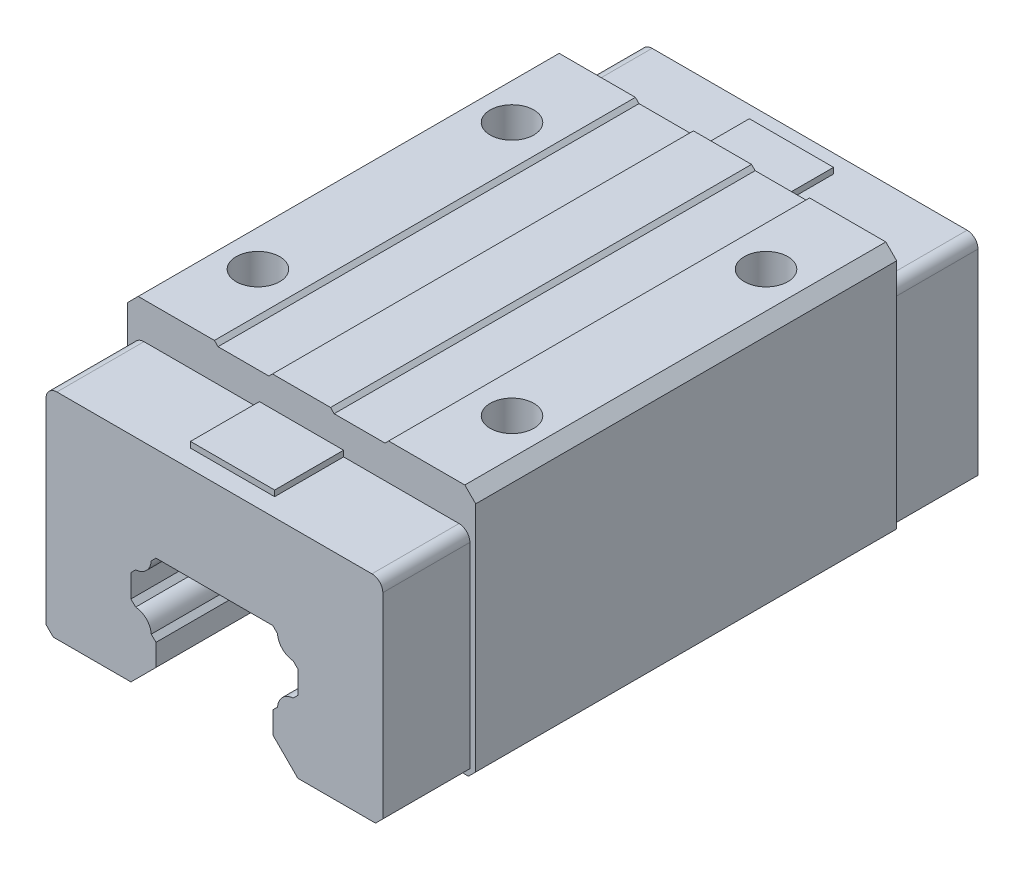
ISO-10303-21;
HEADER;
FILE_DESCRIPTION(('STEP AP214'),'2;1');
FILE_NAME('part.step','',(''),(''),'','','');
FILE_SCHEMA(('AUTOMOTIVE_DESIGN { 1 0 10303 214 1 1 1 1 }'));
ENDSEC;
DATA;
#1=APPLICATION_CONTEXT('core data for automotive mechanical design processes');
#2=APPLICATION_PROTOCOL_DEFINITION('international standard','automotive_design',2000,#1);
#3=PRODUCT_CONTEXT('',#1,'mechanical');
#4=PRODUCT('Part','Part','',(#3));
#5=PRODUCT_RELATED_PRODUCT_CATEGORY('part','',(#4));
#6=PRODUCT_DEFINITION_FORMATION('','',#4);
#7=PRODUCT_DEFINITION_CONTEXT('part definition',#1,'design');
#8=PRODUCT_DEFINITION('design','',#6,#7);
#9=PRODUCT_DEFINITION_SHAPE('','',#8);
#10=(LENGTH_UNIT() NAMED_UNIT(*) SI_UNIT(.MILLI.,.METRE.));
#11=(NAMED_UNIT(*) PLANE_ANGLE_UNIT() SI_UNIT($,.RADIAN.));
#12=(NAMED_UNIT(*) SI_UNIT($,.STERADIAN.) SOLID_ANGLE_UNIT());
#13=UNCERTAINTY_MEASURE_WITH_UNIT(LENGTH_MEASURE(1.E-05),#10,'distance_accuracy_value','');
#14=(GEOMETRIC_REPRESENTATION_CONTEXT(3) GLOBAL_UNCERTAINTY_ASSIGNED_CONTEXT((#13)) GLOBAL_UNIT_ASSIGNED_CONTEXT((#10,
#11,#12)) REPRESENTATION_CONTEXT('',''));
#15=CARTESIAN_POINT('',(0.,0.,0.));
#16=DIRECTION('',(0.,0.,1.));
#17=DIRECTION('',(1.,0.,0.));
#18=AXIS2_PLACEMENT_3D('',#15,#16,#17);
#19=CARTESIAN_POINT('',(-11.5,15.4,48.983916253));
#20=DIRECTION('',(-0.707106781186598,-0.707106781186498,0.));
#21=DIRECTION('',(0.707106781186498,-0.707106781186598,0.));
#22=AXIS2_PLACEMENT_3D('',#19,#20,#21);
#23=PLANE('',#22);
#24=DIRECTION('',(0.,0.,1.));
#25=VECTOR('',#24,1.);
#26=CARTESIAN_POINT('',(-8.05,11.95,48.983916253));
#27=LINE('',#26,#25);
#28=CARTESIAN_POINT('',(-8.05,11.9499999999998,41.));
#29=VERTEX_POINT('',#28);
#30=CARTESIAN_POINT('',(-8.05,11.9499999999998,-41.));
#31=VERTEX_POINT('',#30);
#32=EDGE_CURVE('E427',#29,#31,#27,.F.);
#33=ORIENTED_EDGE('',*,*,#32,.T.);
#34=DIRECTION('',(-0.707106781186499,0.707106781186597,0.));
#35=VECTOR('',#34,1.);
#36=CARTESIAN_POINT('',(-8.05000000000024,11.9499999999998,-41.));
#37=LINE('',#36,#35);
#38=CARTESIAN_POINT('',(-8.69927350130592,12.5992735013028,-41.));
#39=VERTEX_POINT('',#38);
#40=EDGE_CURVE('E18',#39,#31,#37,.F.);
#41=ORIENTED_EDGE('',*,*,#40,.F.);
#42=DIRECTION('',(0.,0.,-1.));
#43=VECTOR('',#42,1.);
#44=CARTESIAN_POINT('',(-8.69927350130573,12.5992735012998,45.00538238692));
#45=LINE('',#44,#43);
#46=CARTESIAN_POINT('',(-8.69927350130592,12.5992735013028,41.));
#47=VERTEX_POINT('',#46);
#48=EDGE_CURVE('E499',#47,#39,#45,.T.);
#49=ORIENTED_EDGE('',*,*,#48,.F.);
#50=DIRECTION('',(0.707106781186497,-0.707106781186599,0.));
#51=VECTOR('',#50,1.);
#52=CARTESIAN_POINT('',(-8.6992735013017,12.5992735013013,41.));
#53=LINE('',#52,#51);
#54=EDGE_CURVE('E425',#29,#47,#53,.F.);
#55=ORIENTED_EDGE('',*,*,#54,.F.);
#56=EDGE_LOOP('',(#33,#41,#49,#55));
#57=FACE_BOUND('',#56,.T.);
#58=ADVANCED_FACE('F15',(#57),#23,.F.);
#59=CARTESIAN_POINT('',(-11.5,15.4,48.983916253));
#60=DIRECTION('',(-0.707106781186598,-0.707106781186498,0.));
#61=DIRECTION('',(0.707106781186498,-0.707106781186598,0.));
#62=AXIS2_PLACEMENT_3D('',#59,#60,#61);
#63=PLANE('',#62);
#64=DIRECTION('',(0.,0.,-1.));
#65=VECTOR('',#64,1.);
#66=CARTESIAN_POINT('',(-10.8507264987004,14.7507264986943,45.00538238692));
#67=LINE('',#66,#65);
#68=CARTESIAN_POINT('',(-10.8507264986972,14.7507264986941,-41.));
#69=VERTEX_POINT('',#68);
#70=CARTESIAN_POINT('',(-10.8507264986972,14.7507264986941,41.));
#71=VERTEX_POINT('',#70);
#72=EDGE_CURVE('E501',#69,#71,#67,.F.);
#73=ORIENTED_EDGE('',*,*,#72,.F.);
#74=DIRECTION('',(-0.707106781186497,0.707106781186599,0.));
#75=VECTOR('',#74,1.);
#76=CARTESIAN_POINT('',(-10.8507264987,14.7507264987,-41.));
#77=LINE('',#76,#75);
#78=CARTESIAN_POINT('',(-11.5,15.4,-41.));
#79=VERTEX_POINT('',#78);
#80=EDGE_CURVE('E492',#79,#69,#77,.F.);
#81=ORIENTED_EDGE('',*,*,#80,.F.);
#82=DIRECTION('',(0.,0.,1.));
#83=VECTOR('',#82,1.);
#84=CARTESIAN_POINT('',(-11.5,15.4,-38.50005));
#85=LINE('',#84,#83);
#86=CARTESIAN_POINT('',(-11.5,15.4,41.));
#87=VERTEX_POINT('',#86);
#88=EDGE_CURVE('E605',#79,#87,#85,.T.);
#89=ORIENTED_EDGE('',*,*,#88,.T.);
#90=DIRECTION('',(0.707106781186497,-0.707106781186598,0.));
#91=VECTOR('',#90,1.);
#92=CARTESIAN_POINT('',(-11.5,15.4,41.));
#93=LINE('',#92,#91);
#94=EDGE_CURVE('E490',#71,#87,#93,.F.);
#95=ORIENTED_EDGE('',*,*,#94,.F.);
#96=EDGE_LOOP('',(#73,#81,#89,#95));
#97=FACE_BOUND('',#96,.T.);
#98=ADVANCED_FACE('F1379',(#97),#63,.F.);
#99=CARTESIAN_POINT('',(-8.05,22.,43.37903679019));
#100=DIRECTION('',(-0.707106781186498,0.707106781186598,0.));
#101=DIRECTION('',(-0.707106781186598,-0.707106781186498,0.));
#102=AXIS2_PLACEMENT_3D('',#99,#100,#101);
#103=PLANE('',#102);
#104=DIRECTION('',(0.,0.,1.));
#105=VECTOR('',#104,1.);
#106=CARTESIAN_POINT('',(-11.5,18.55,-38.50005));
#107=LINE('',#106,#105);
#108=CARTESIAN_POINT('',(-11.5,18.5500000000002,41.));
#109=VERTEX_POINT('',#108);
#110=CARTESIAN_POINT('',(-11.5,18.5500000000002,-41.));
#111=VERTEX_POINT('',#110);
#112=EDGE_CURVE('E608',#109,#111,#107,.F.);
#113=ORIENTED_EDGE('',*,*,#112,.T.);
#114=DIRECTION('',(0.707106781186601,0.707106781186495,0.));
#115=VECTOR('',#114,1.);
#116=CARTESIAN_POINT('',(-11.5000000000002,18.5500000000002,-41.));
#117=LINE('',#116,#115);
#118=CARTESIAN_POINT('',(-10.8507264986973,19.1992735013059,-41.));
#119=VERTEX_POINT('',#118);
#120=EDGE_CURVE('E488',#119,#111,#117,.F.);
#121=ORIENTED_EDGE('',*,*,#120,.F.);
#122=DIRECTION('',(0.,0.,-1.));
#123=VECTOR('',#122,1.);
#124=CARTESIAN_POINT('',(-10.8507264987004,19.1992735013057,45.00538238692));
#125=LINE('',#124,#123);
#126=CARTESIAN_POINT('',(-10.8507264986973,19.1992735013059,41.));
#127=VERTEX_POINT('',#126);
#128=EDGE_CURVE('E602',#127,#119,#125,.T.);
#129=ORIENTED_EDGE('',*,*,#128,.F.);
#130=DIRECTION('',(-0.707106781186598,-0.707106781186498,0.));
#131=VECTOR('',#130,1.);
#132=CARTESIAN_POINT('',(-10.8507264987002,19.1992735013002,41.));
#133=LINE('',#132,#131);
#134=EDGE_CURVE('E486',#109,#127,#133,.F.);
#135=ORIENTED_EDGE('',*,*,#134,.F.);
#136=EDGE_LOOP('',(#113,#121,#129,#135));
#137=FACE_BOUND('',#136,.T.);
#138=ADVANCED_FACE('F1377',(#137),#103,.F.);
#139=CARTESIAN_POINT('',(-8.05,22.,43.37903679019));
#140=DIRECTION('',(-0.707106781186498,0.707106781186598,0.));
#141=DIRECTION('',(-0.707106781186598,-0.707106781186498,0.));
#142=AXIS2_PLACEMENT_3D('',#139,#140,#141);
#143=PLANE('',#142);
#144=DIRECTION('',(0.,0.,-1.));
#145=VECTOR('',#144,1.);
#146=CARTESIAN_POINT('',(-8.69927350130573,21.3507264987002,45.00538238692));
#147=LINE('',#146,#145);
#148=CARTESIAN_POINT('',(-8.69927350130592,21.3507264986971,-41.));
#149=VERTEX_POINT('',#148);
#150=CARTESIAN_POINT('',(-8.69927350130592,21.3507264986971,41.));
#151=VERTEX_POINT('',#150);
#152=EDGE_CURVE('E599',#149,#151,#147,.F.);
#153=ORIENTED_EDGE('',*,*,#152,.F.);
#154=DIRECTION('',(0.707106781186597,0.707106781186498,0.));
#155=VECTOR('',#154,1.);
#156=CARTESIAN_POINT('',(-8.69927350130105,21.350726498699,-41.));
#157=LINE('',#156,#155);
#158=CARTESIAN_POINT('',(-8.05,22.,-41.));
#159=VERTEX_POINT('',#158);
#160=EDGE_CURVE('E484',#159,#149,#157,.F.);
#161=ORIENTED_EDGE('',*,*,#160,.F.);
#162=DIRECTION('',(0.,0.,1.));
#163=VECTOR('',#162,1.);
#164=CARTESIAN_POINT('',(-8.05,22.,-38.50005));
#165=LINE('',#164,#163);
#166=CARTESIAN_POINT('',(-8.05,22.,41.));
#167=VERTEX_POINT('',#166);
#168=EDGE_CURVE('E593',#159,#167,#165,.T.);
#169=ORIENTED_EDGE('',*,*,#168,.T.);
#170=DIRECTION('',(-0.707106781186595,-0.7071067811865,0.));
#171=VECTOR('',#170,1.);
#172=CARTESIAN_POINT('',(-8.05,22.,41.));
#173=LINE('',#172,#171);
#174=EDGE_CURVE('E482',#151,#167,#173,.F.);
#175=ORIENTED_EDGE('',*,*,#174,.F.);
#176=EDGE_LOOP('',(#153,#161,#169,#175));
#177=FACE_BOUND('',#176,.T.);
#178=ADVANCED_FACE('F778',(#177),#143,.F.);
#179=CARTESIAN_POINT('',(8.05,22.,43.37903679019));
#180=DIRECTION('',(0.707106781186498,0.707106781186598,0.));
#181=DIRECTION('',(-0.707106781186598,0.707106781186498,0.));
#182=AXIS2_PLACEMENT_3D('',#179,#180,#181);
#183=PLANE('',#182);
#184=DIRECTION('',(0.,0.,1.));
#185=VECTOR('',#184,1.);
#186=CARTESIAN_POINT('',(8.05,22.,-38.50005));
#187=LINE('',#186,#185);
#188=CARTESIAN_POINT('',(8.05,22.,41.));
#189=VERTEX_POINT('',#188);
#190=CARTESIAN_POINT('',(8.05,22.,-41.));
#191=VERTEX_POINT('',#190);
#192=EDGE_CURVE('E596',#189,#191,#187,.F.);
#193=ORIENTED_EDGE('',*,*,#192,.T.);
#194=DIRECTION('',(0.707106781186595,-0.7071067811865,0.));
#195=VECTOR('',#194,1.);
#196=CARTESIAN_POINT('',(8.05,22.,-41.));
#197=LINE('',#196,#195);
#198=CARTESIAN_POINT('',(8.69927350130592,21.3507264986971,-41.));
#199=VERTEX_POINT('',#198);
#200=EDGE_CURVE('E480',#199,#191,#197,.F.);
#201=ORIENTED_EDGE('',*,*,#200,.F.);
#202=DIRECTION('',(0.,0.,-1.));
#203=VECTOR('',#202,1.);
#204=CARTESIAN_POINT('',(8.69927350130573,21.3507264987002,45.00538238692));
#205=LINE('',#204,#203);
#206=CARTESIAN_POINT('',(8.69927350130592,21.3507264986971,41.));
#207=VERTEX_POINT('',#206);
#208=EDGE_CURVE('E590',#207,#199,#205,.T.);
#209=ORIENTED_EDGE('',*,*,#208,.F.);
#210=DIRECTION('',(-0.707106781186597,0.707106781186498,0.));
#211=VECTOR('',#210,1.);
#212=CARTESIAN_POINT('',(8.69927350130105,21.350726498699,41.));
#213=LINE('',#212,#211);
#214=EDGE_CURVE('E478',#189,#207,#213,.F.);
#215=ORIENTED_EDGE('',*,*,#214,.F.);
#216=EDGE_LOOP('',(#193,#201,#209,#215));
#217=FACE_BOUND('',#216,.T.);
#218=ADVANCED_FACE('F788',(#217),#183,.F.);
#219=CARTESIAN_POINT('',(8.05,22.,43.37903679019));
#220=DIRECTION('',(0.707106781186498,0.707106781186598,0.));
#221=DIRECTION('',(-0.707106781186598,0.707106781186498,0.));
#222=AXIS2_PLACEMENT_3D('',#219,#220,#221);
#223=PLANE('',#222);
#224=DIRECTION('',(0.,0.,-1.));
#225=VECTOR('',#224,1.);
#226=CARTESIAN_POINT('',(10.8507264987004,19.1992735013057,45.00538238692));
#227=LINE('',#226,#225);
#228=CARTESIAN_POINT('',(10.8507264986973,19.1992735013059,-41.));
#229=VERTEX_POINT('',#228);
#230=CARTESIAN_POINT('',(10.8507264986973,19.1992735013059,41.));
#231=VERTEX_POINT('',#230);
#232=EDGE_CURVE('E587',#229,#231,#227,.F.);
#233=ORIENTED_EDGE('',*,*,#232,.F.);
#234=DIRECTION('',(0.707106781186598,-0.707106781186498,0.));
#235=VECTOR('',#234,1.);
#236=CARTESIAN_POINT('',(10.8507264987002,19.1992735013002,-41.));
#237=LINE('',#236,#235);
#238=CARTESIAN_POINT('',(11.5,18.5500000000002,-41.));
#239=VERTEX_POINT('',#238);
#240=EDGE_CURVE('E476',#239,#229,#237,.F.);
#241=ORIENTED_EDGE('',*,*,#240,.F.);
#242=DIRECTION('',(0.,0.,-1.));
#243=VECTOR('',#242,1.);
#244=CARTESIAN_POINT('',(11.5,18.55,-38.50005));
#245=LINE('',#244,#243);
#246=CARTESIAN_POINT('',(11.5,18.5500000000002,41.));
#247=VERTEX_POINT('',#246);
#248=EDGE_CURVE('E581',#239,#247,#245,.F.);
#249=ORIENTED_EDGE('',*,*,#248,.T.);
#250=DIRECTION('',(-0.707106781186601,0.707106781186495,0.));
#251=VECTOR('',#250,1.);
#252=CARTESIAN_POINT('',(11.5000000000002,18.5500000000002,41.));
#253=LINE('',#252,#251);
#254=EDGE_CURVE('E474',#231,#247,#253,.F.);
#255=ORIENTED_EDGE('',*,*,#254,.F.);
#256=EDGE_LOOP('',(#233,#241,#249,#255));
#257=FACE_BOUND('',#256,.T.);
#258=ADVANCED_FACE('F794',(#257),#223,.F.);
#259=CARTESIAN_POINT('',(11.5,15.4,48.983916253));
#260=DIRECTION('',(0.707106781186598,-0.707106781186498,0.));
#261=DIRECTION('',(0.707106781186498,0.707106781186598,0.));
#262=AXIS2_PLACEMENT_3D('',#259,#260,#261);
#263=PLANE('',#262);
#264=DIRECTION('',(0.,0.,-1.));
#265=VECTOR('',#264,1.);
#266=CARTESIAN_POINT('',(11.5,15.4,-38.50005));
#267=LINE('',#266,#265);
#268=CARTESIAN_POINT('',(11.5,15.4,41.));
#269=VERTEX_POINT('',#268);
#270=CARTESIAN_POINT('',(11.5,15.4,-41.));
#271=VERTEX_POINT('',#270);
#272=EDGE_CURVE('E584',#269,#271,#267,.T.);
#273=ORIENTED_EDGE('',*,*,#272,.T.);
#274=DIRECTION('',(-0.707106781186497,-0.707106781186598,0.));
#275=VECTOR('',#274,1.);
#276=CARTESIAN_POINT('',(11.5,15.4,-41.));
#277=LINE('',#276,#275);
#278=CARTESIAN_POINT('',(10.8507264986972,14.7507264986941,-41.));
#279=VERTEX_POINT('',#278);
#280=EDGE_CURVE('E472',#279,#271,#277,.F.);
#281=ORIENTED_EDGE('',*,*,#280,.F.);
#282=DIRECTION('',(0.,0.,-1.));
#283=VECTOR('',#282,1.);
#284=CARTESIAN_POINT('',(10.8507264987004,14.7507264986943,45.00538238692));
#285=LINE('',#284,#283);
#286=CARTESIAN_POINT('',(10.8507264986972,14.7507264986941,41.));
#287=VERTEX_POINT('',#286);
#288=EDGE_CURVE('E578',#287,#279,#285,.T.);
#289=ORIENTED_EDGE('',*,*,#288,.F.);
#290=DIRECTION('',(0.707106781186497,0.707106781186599,0.));
#291=VECTOR('',#290,1.);
#292=CARTESIAN_POINT('',(10.8507264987,14.7507264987,41.));
#293=LINE('',#292,#291);
#294=EDGE_CURVE('E470',#269,#287,#293,.F.);
#295=ORIENTED_EDGE('',*,*,#294,.F.);
#296=EDGE_LOOP('',(#273,#281,#289,#295));
#297=FACE_BOUND('',#296,.T.);
#298=ADVANCED_FACE('F803',(#297),#263,.F.);
#299=CARTESIAN_POINT('',(11.5,15.4,48.983916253));
#300=DIRECTION('',(0.707106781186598,-0.707106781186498,0.));
#301=DIRECTION('',(0.707106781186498,0.707106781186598,0.));
#302=AXIS2_PLACEMENT_3D('',#299,#300,#301);
#303=PLANE('',#302);
#304=DIRECTION('',(0.,0.,-1.));
#305=VECTOR('',#304,1.);
#306=CARTESIAN_POINT('',(8.69927350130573,12.5992735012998,45.00538238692));
#307=LINE('',#306,#305);
#308=CARTESIAN_POINT('',(8.69927350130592,12.5992735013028,-41.));
#309=VERTEX_POINT('',#308);
#310=CARTESIAN_POINT('',(8.69927350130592,12.5992735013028,41.));
#311=VERTEX_POINT('',#310);
#312=EDGE_CURVE('E575',#309,#311,#307,.F.);
#313=ORIENTED_EDGE('',*,*,#312,.F.);
#314=DIRECTION('',(-0.707106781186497,-0.707106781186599,0.));
#315=VECTOR('',#314,1.);
#316=CARTESIAN_POINT('',(8.6992735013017,12.5992735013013,-41.));
#317=LINE('',#316,#315);
#318=CARTESIAN_POINT('',(8.05,11.9499999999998,-41.));
#319=VERTEX_POINT('',#318);
#320=EDGE_CURVE('E468',#319,#309,#317,.F.);
#321=ORIENTED_EDGE('',*,*,#320,.F.);
#322=DIRECTION('',(0.,0.,-1.));
#323=VECTOR('',#322,1.);
#324=CARTESIAN_POINT('',(8.05,11.95,48.983916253));
#325=LINE('',#324,#323);
#326=CARTESIAN_POINT('',(8.05,11.9499999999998,41.));
#327=VERTEX_POINT('',#326);
#328=EDGE_CURVE('E572',#319,#327,#325,.F.);
#329=ORIENTED_EDGE('',*,*,#328,.T.);
#330=DIRECTION('',(0.707106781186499,0.707106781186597,0.));
#331=VECTOR('',#330,1.);
#332=CARTESIAN_POINT('',(8.05000000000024,11.9499999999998,41.));
#333=LINE('',#332,#331);
#334=EDGE_CURVE('E465',#311,#327,#333,.F.);
#335=ORIENTED_EDGE('',*,*,#334,.F.);
#336=EDGE_LOOP('',(#313,#321,#329,#335));
#337=FACE_BOUND('',#336,.T.);
#338=ADVANCED_FACE('F812',(#337),#303,.F.);
#339=CARTESIAN_POINT('',(-23.2,5.5,-38.50005));
#340=DIRECTION('',(0.,1.,0.));
#341=DIRECTION('',(0.,0.,1.));
#342=AXIS2_PLACEMENT_3D('',#339,#340,#341);
#343=PLANE('',#342);
#344=DIRECTION('',(0.,0.,1.));
#345=VECTOR('',#344,1.);
#346=CARTESIAN_POINT('',(-22.2,5.5,38.50005));
#347=LINE('',#346,#345);
#348=CARTESIAN_POINT('',(-22.2,5.5,29.));
#349=VERTEX_POINT('',#348);
#350=CARTESIAN_POINT('',(-22.2,5.5,41.));
#351=VERTEX_POINT('',#350);
#352=EDGE_CURVE('E615',#349,#351,#347,.T.);
#353=ORIENTED_EDGE('',*,*,#352,.F.);
#354=DIRECTION('',(1.,0.,0.));
#355=VECTOR('',#354,1.);
#356=CARTESIAN_POINT('',(-23.2,5.5,29.));
#357=LINE('',#356,#355);
#358=CARTESIAN_POINT('',(-22.5,5.5,29.));
#359=VERTEX_POINT('',#358);
#360=EDGE_CURVE('E614',#359,#349,#357,.T.);
#361=ORIENTED_EDGE('',*,*,#360,.F.);
#362=DIRECTION('',(0.,0.,1.));
#363=VECTOR('',#362,1.);
#364=CARTESIAN_POINT('',(-22.5,5.5,-30.41421356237));
#365=LINE('',#364,#363);
#366=CARTESIAN_POINT('',(-22.5,5.5,-29.));
#367=VERTEX_POINT('',#366);
#368=EDGE_CURVE('E685',#359,#367,#365,.F.);
#369=ORIENTED_EDGE('',*,*,#368,.T.);
#370=DIRECTION('',(1.,0.,0.));
#371=VECTOR('',#370,1.);
#372=CARTESIAN_POINT('',(-23.2,5.5,-29.));
#373=LINE('',#372,#371);
#374=CARTESIAN_POINT('',(-22.2,5.5,-29.));
#375=VERTEX_POINT('',#374);
#376=EDGE_CURVE('E467',#375,#367,#373,.F.);
#377=ORIENTED_EDGE('',*,*,#376,.F.);
#378=DIRECTION('',(0.,0.,1.));
#379=VECTOR('',#378,1.);
#380=CARTESIAN_POINT('',(-22.2,5.5,-38.50005));
#381=LINE('',#380,#379);
#382=CARTESIAN_POINT('',(-22.2,5.5,-41.));
#383=VERTEX_POINT('',#382);
#384=EDGE_CURVE('E534',#375,#383,#381,.F.);
#385=ORIENTED_EDGE('',*,*,#384,.T.);
#386=DIRECTION('',(-1.,0.,0.));
#387=VECTOR('',#386,1.);
#388=CARTESIAN_POINT('',(23.2,5.5,-41.));
#389=LINE('',#388,#387);
#390=CARTESIAN_POINT('',(-11.4999999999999,5.49999999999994,-41.));
#391=VERTEX_POINT('',#390);
#392=EDGE_CURVE('E438',#391,#383,#389,.T.);
#393=ORIENTED_EDGE('',*,*,#392,.F.);
#394=DIRECTION('',(0.,0.,1.));
#395=VECTOR('',#394,1.);
#396=CARTESIAN_POINT('',(-11.4999999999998,5.49999999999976,48.983916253));
#397=LINE('',#396,#395);
#398=CARTESIAN_POINT('',(-11.4999999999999,5.49999999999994,41.));
#399=VERTEX_POINT('',#398);
#400=EDGE_CURVE('E432',#391,#399,#397,.T.);
#401=ORIENTED_EDGE('',*,*,#400,.T.);
#402=DIRECTION('',(1.,0.,0.));
#403=VECTOR('',#402,1.);
#404=CARTESIAN_POINT('',(-23.2,5.5,41.));
#405=LINE('',#404,#403);
#406=EDGE_CURVE('E516',#351,#399,#405,.T.);
#407=ORIENTED_EDGE('',*,*,#406,.F.);
#408=EDGE_LOOP('',(#353,#361,#369,#377,#385,#393,#401,#407));
#409=FACE_BOUND('',#408,.T.);
#410=ADVANCED_FACE('F1349',(#409),#343,.F.);
#411=CARTESIAN_POINT('',(-8.05,8.95,48.983916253));
#412=DIRECTION('',(-0.707106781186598,0.707106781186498,0.));
#413=DIRECTION('',(-0.707106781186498,-0.707106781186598,0.));
#414=AXIS2_PLACEMENT_3D('',#411,#412,#413);
#415=PLANE('',#414);
#416=ORIENTED_EDGE('',*,*,#400,.F.);
#417=DIRECTION('',(0.707106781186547,0.707106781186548,0.));
#418=VECTOR('',#417,1.);
#419=CARTESIAN_POINT('',(-11.5,5.5,-41.));
#420=LINE('',#419,#418);
#421=CARTESIAN_POINT('',(-8.05,8.95,-41.));
#422=VERTEX_POINT('',#421);
#423=EDGE_CURVE('E436',#422,#391,#420,.F.);
#424=ORIENTED_EDGE('',*,*,#423,.F.);
#425=DIRECTION('',(0.,0.,1.));
#426=VECTOR('',#425,1.);
#427=CARTESIAN_POINT('',(-8.05,8.95,48.983916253));
#428=LINE('',#427,#426);
#429=CARTESIAN_POINT('',(-8.05,8.95,41.));
#430=VERTEX_POINT('',#429);
#431=EDGE_CURVE('E431',#422,#430,#428,.T.);
#432=ORIENTED_EDGE('',*,*,#431,.T.);
#433=DIRECTION('',(-0.707106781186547,-0.707106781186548,0.));
#434=VECTOR('',#433,1.);
#435=CARTESIAN_POINT('',(-8.05,8.95,41.));
#436=LINE('',#435,#434);
#437=EDGE_CURVE('E511',#399,#430,#436,.F.);
#438=ORIENTED_EDGE('',*,*,#437,.F.);
#439=EDGE_LOOP('',(#416,#424,#432,#438));
#440=FACE_BOUND('',#439,.T.);
#441=ADVANCED_FACE('F1356',(#440),#415,.F.);
#442=CARTESIAN_POINT('',(-8.05,11.95,48.983916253));
#443=DIRECTION('',(-1.,0.,0.));
#444=DIRECTION('',(0.,0.,1.));
#445=AXIS2_PLACEMENT_3D('',#442,#443,#444);
#446=PLANE('',#445);
#447=ORIENTED_EDGE('',*,*,#431,.F.);
#448=DIRECTION('',(0.,1.,0.));
#449=VECTOR('',#448,1.);
#450=CARTESIAN_POINT('',(-8.05,5.5,-41.));
#451=LINE('',#450,#449);
#452=EDGE_CURVE('E421',#31,#422,#451,.F.);
#453=ORIENTED_EDGE('',*,*,#452,.F.);
#454=ORIENTED_EDGE('',*,*,#32,.F.);
#455=DIRECTION('',(0.,1.,0.));
#456=VECTOR('',#455,1.);
#457=CARTESIAN_POINT('',(-8.05,5.5,41.));
#458=LINE('',#457,#456);
#459=EDGE_CURVE('E498',#430,#29,#458,.T.);
#460=ORIENTED_EDGE('',*,*,#459,.F.);
#461=EDGE_LOOP('',(#447,#453,#454,#460));
#462=FACE_BOUND('',#461,.T.);
#463=ADVANCED_FACE('F434',(#462),#446,.F.);
#464=CARTESIAN_POINT('',(-10.99475919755,12.45524080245,45.00538238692));
#465=DIRECTION('',(0.,0.,-1.));
#466=DIRECTION('',(-1.,0.,0.));
#467=AXIS2_PLACEMENT_3D('',#464,#465,#466);
#468=CYLINDRICAL_SURFACE('',#467,2.3);
#469=CARTESIAN_POINT('',(-10.99475919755,12.45524080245,-41.));
#470=DIRECTION('',(0.,0.,-1.));
#471=DIRECTION('',(-1.,0.,0.));
#472=AXIS2_PLACEMENT_3D('',#469,#470,#471);
#473=CIRCLE('',#472,2.3);
#474=EDGE_CURVE('E424',#69,#39,#473,.T.);
#475=ORIENTED_EDGE('',*,*,#474,.F.);
#476=ORIENTED_EDGE('',*,*,#72,.T.);
#477=CARTESIAN_POINT('',(-10.99475919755,12.45524080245,41.));
#478=DIRECTION('',(0.,0.,1.));
#479=DIRECTION('',(1.,0.,0.));
#480=AXIS2_PLACEMENT_3D('',#477,#478,#479);
#481=CIRCLE('',#480,2.3);
#482=EDGE_CURVE('E497',#47,#71,#481,.T.);
#483=ORIENTED_EDGE('',*,*,#482,.F.);
#484=ORIENTED_EDGE('',*,*,#48,.T.);
#485=EDGE_LOOP('',(#475,#476,#483,#484));
#486=FACE_BOUND('',#485,.T.);
#487=ADVANCED_FACE('F504',(#486),#468,.T.);
#488=CARTESIAN_POINT('',(-11.5,0.,-38.50005));
#489=DIRECTION('',(-1.,0.,0.));
#490=DIRECTION('',(0.,0.,1.));
#491=AXIS2_PLACEMENT_3D('',#488,#489,#490);
#492=PLANE('',#491);
#493=ORIENTED_EDGE('',*,*,#88,.F.);
#494=DIRECTION('',(0.,1.,0.));
#495=VECTOR('',#494,1.);
#496=CARTESIAN_POINT('',(-11.5,5.5,-41.));
#497=LINE('',#496,#495);
#498=EDGE_CURVE('E440',#111,#79,#497,.F.);
#499=ORIENTED_EDGE('',*,*,#498,.F.);
#500=ORIENTED_EDGE('',*,*,#112,.F.);
#501=DIRECTION('',(0.,1.,0.));
#502=VECTOR('',#501,1.);
#503=CARTESIAN_POINT('',(-11.5,5.5,41.));
#504=LINE('',#503,#502);
#505=EDGE_CURVE('E506',#87,#109,#504,.T.);
#506=ORIENTED_EDGE('',*,*,#505,.F.);
#507=EDGE_LOOP('',(#493,#499,#500,#506));
#508=FACE_BOUND('',#507,.T.);
#509=ADVANCED_FACE('F1390',(#508),#492,.F.);
#510=CARTESIAN_POINT('',(-10.99475919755,21.49475919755,45.00538238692));
#511=DIRECTION('',(0.,0.,-1.));
#512=DIRECTION('',(-1.,0.,0.));
#513=AXIS2_PLACEMENT_3D('',#510,#511,#512);
#514=CYLINDRICAL_SURFACE('',#513,2.3);
#515=CARTESIAN_POINT('',(-10.99475919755,21.49475919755,-41.));
#516=DIRECTION('',(0.,0.,-1.));
#517=DIRECTION('',(-1.,0.,0.));
#518=AXIS2_PLACEMENT_3D('',#515,#516,#517);
#519=CIRCLE('',#518,2.3);
#520=EDGE_CURVE('E446',#149,#119,#519,.T.);
#521=ORIENTED_EDGE('',*,*,#520,.F.);
#522=ORIENTED_EDGE('',*,*,#152,.T.);
#523=CARTESIAN_POINT('',(-10.99475919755,21.49475919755,41.));
#524=DIRECTION('',(0.,0.,1.));
#525=DIRECTION('',(1.,0.,0.));
#526=AXIS2_PLACEMENT_3D('',#523,#524,#525);
#527=CIRCLE('',#526,2.3);
#528=EDGE_CURVE('E509',#127,#151,#527,.T.);
#529=ORIENTED_EDGE('',*,*,#528,.F.);
#530=ORIENTED_EDGE('',*,*,#128,.T.);
#531=EDGE_LOOP('',(#521,#522,#529,#530));
#532=FACE_BOUND('',#531,.T.);
#533=ADVANCED_FACE('F775',(#532),#514,.T.);
#534=CARTESIAN_POINT('',(-11.5,22.,-38.50005));
#535=DIRECTION('',(0.,1.,0.));
#536=DIRECTION('',(0.,0.,1.));
#537=AXIS2_PLACEMENT_3D('',#534,#535,#536);
#538=PLANE('',#537);
#539=ORIENTED_EDGE('',*,*,#168,.F.);
#540=DIRECTION('',(-1.,0.,0.));
#541=VECTOR('',#540,1.);
#542=CARTESIAN_POINT('',(23.2,22.,-41.));
#543=LINE('',#542,#541);
#544=EDGE_CURVE('E449',#191,#159,#543,.T.);
#545=ORIENTED_EDGE('',*,*,#544,.F.);
#546=ORIENTED_EDGE('',*,*,#192,.F.);
#547=DIRECTION('',(1.,0.,0.));
#548=VECTOR('',#547,1.);
#549=CARTESIAN_POINT('',(-23.2,22.,41.));
#550=LINE('',#549,#548);
#551=EDGE_CURVE('E768',#167,#189,#550,.T.);
#552=ORIENTED_EDGE('',*,*,#551,.F.);
#553=EDGE_LOOP('',(#539,#545,#546,#552));
#554=FACE_BOUND('',#553,.T.);
#555=ADVANCED_FACE('F784',(#554),#538,.F.);
#556=CARTESIAN_POINT('',(10.99475919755,21.49475919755,45.00538238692));
#557=DIRECTION('',(0.,0.,-1.));
#558=DIRECTION('',(-1.,0.,0.));
#559=AXIS2_PLACEMENT_3D('',#556,#557,#558);
#560=CYLINDRICAL_SURFACE('',#559,2.3);
#561=CARTESIAN_POINT('',(10.99475919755,21.49475919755,-41.));
#562=DIRECTION('',(0.,0.,-1.));
#563=DIRECTION('',(-1.,0.,0.));
#564=AXIS2_PLACEMENT_3D('',#561,#562,#563);
#565=CIRCLE('',#564,2.3);
#566=EDGE_CURVE('E452',#229,#199,#565,.T.);
#567=ORIENTED_EDGE('',*,*,#566,.F.);
#568=ORIENTED_EDGE('',*,*,#232,.T.);
#569=CARTESIAN_POINT('',(10.99475919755,21.49475919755,41.));
#570=DIRECTION('',(0.,0.,1.));
#571=DIRECTION('',(1.,0.,0.));
#572=AXIS2_PLACEMENT_3D('',#569,#570,#571);
#573=CIRCLE('',#572,2.3);
#574=EDGE_CURVE('E765',#207,#231,#573,.T.);
#575=ORIENTED_EDGE('',*,*,#574,.F.);
#576=ORIENTED_EDGE('',*,*,#208,.T.);
#577=EDGE_LOOP('',(#567,#568,#575,#576));
#578=FACE_BOUND('',#577,.T.);
#579=ADVANCED_FACE('F791',(#578),#560,.T.);
#580=CARTESIAN_POINT('',(11.5,0.,-38.50005));
#581=DIRECTION('',(1.,0.,0.));
#582=DIRECTION('',(0.,0.,-1.));
#583=AXIS2_PLACEMENT_3D('',#580,#581,#582);
#584=PLANE('',#583);
#585=ORIENTED_EDGE('',*,*,#248,.F.);
#586=DIRECTION('',(0.,1.,0.));
#587=VECTOR('',#586,1.);
#588=CARTESIAN_POINT('',(11.5,5.5,-41.));
#589=LINE('',#588,#587);
#590=EDGE_CURVE('E455',#271,#239,#589,.T.);
#591=ORIENTED_EDGE('',*,*,#590,.F.);
#592=ORIENTED_EDGE('',*,*,#272,.F.);
#593=DIRECTION('',(0.,1.,0.));
#594=VECTOR('',#593,1.);
#595=CARTESIAN_POINT('',(11.5,5.5,41.));
#596=LINE('',#595,#594);
#597=EDGE_CURVE('E762',#247,#269,#596,.F.);
#598=ORIENTED_EDGE('',*,*,#597,.F.);
#599=EDGE_LOOP('',(#585,#591,#592,#598));
#600=FACE_BOUND('',#599,.T.);
#601=ADVANCED_FACE('F800',(#600),#584,.F.);
#602=CARTESIAN_POINT('',(10.99475919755,12.45524080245,45.00538238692));
#603=DIRECTION('',(0.,0.,-1.));
#604=DIRECTION('',(-1.,0.,0.));
#605=AXIS2_PLACEMENT_3D('',#602,#603,#604);
#606=CYLINDRICAL_SURFACE('',#605,2.3);
#607=CARTESIAN_POINT('',(10.99475919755,12.45524080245,-41.));
#608=DIRECTION('',(0.,0.,-1.));
#609=DIRECTION('',(-1.,0.,0.));
#610=AXIS2_PLACEMENT_3D('',#607,#608,#609);
#611=CIRCLE('',#610,2.3);
#612=EDGE_CURVE('E458',#309,#279,#611,.T.);
#613=ORIENTED_EDGE('',*,*,#612,.F.);
#614=ORIENTED_EDGE('',*,*,#312,.T.);
#615=CARTESIAN_POINT('',(10.99475919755,12.45524080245,41.));
#616=DIRECTION('',(0.,0.,1.));
#617=DIRECTION('',(1.,0.,0.));
#618=AXIS2_PLACEMENT_3D('',#615,#616,#617);
#619=CIRCLE('',#618,2.3);
#620=EDGE_CURVE('E759',#287,#311,#619,.T.);
#621=ORIENTED_EDGE('',*,*,#620,.F.);
#622=ORIENTED_EDGE('',*,*,#288,.T.);
#623=EDGE_LOOP('',(#613,#614,#621,#622));
#624=FACE_BOUND('',#623,.T.);
#625=ADVANCED_FACE('F807',(#624),#606,.T.);
#626=CARTESIAN_POINT('',(8.05,11.95,48.983916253));
#627=DIRECTION('',(1.,0.,0.));
#628=DIRECTION('',(0.,0.,-1.));
#629=AXIS2_PLACEMENT_3D('',#626,#627,#628);
#630=PLANE('',#629);
#631=ORIENTED_EDGE('',*,*,#328,.F.);
#632=DIRECTION('',(0.,1.,0.));
#633=VECTOR('',#632,1.);
#634=CARTESIAN_POINT('',(8.05,5.5,-41.));
#635=LINE('',#634,#633);
#636=CARTESIAN_POINT('',(8.05,8.95,-41.));
#637=VERTEX_POINT('',#636);
#638=EDGE_CURVE('E461',#637,#319,#635,.T.);
#639=ORIENTED_EDGE('',*,*,#638,.F.);
#640=DIRECTION('',(0.,0.,1.));
#641=VECTOR('',#640,1.);
#642=CARTESIAN_POINT('',(8.05,8.95,48.983916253));
#643=LINE('',#642,#641);
#644=CARTESIAN_POINT('',(8.05,8.95,41.));
#645=VERTEX_POINT('',#644);
#646=EDGE_CURVE('E521',#637,#645,#643,.T.);
#647=ORIENTED_EDGE('',*,*,#646,.T.);
#648=DIRECTION('',(0.,1.,0.));
#649=VECTOR('',#648,1.);
#650=CARTESIAN_POINT('',(8.05,5.5,41.));
#651=LINE('',#650,#649);
#652=EDGE_CURVE('E757',#327,#645,#651,.F.);
#653=ORIENTED_EDGE('',*,*,#652,.F.);
#654=EDGE_LOOP('',(#631,#639,#647,#653));
#655=FACE_BOUND('',#654,.T.);
#656=ADVANCED_FACE('F814',(#655),#630,.F.);
#657=CARTESIAN_POINT('',(-17.5,28.9000000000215,-17.5));
#658=DIRECTION('',(0.,1.,0.));
#659=DIRECTION('',(0.,0.,1.));
#660=AXIS2_PLACEMENT_3D('',#657,#658,#659);
#661=CONICAL_SURFACE('',#660,2.99999999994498,1.02974425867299);
#662=CARTESIAN_POINT('',(-17.5,28.9,-17.5));
#663=DIRECTION('',(0.,1.,0.));
#664=DIRECTION('',(0.,0.,1.));
#665=AXIS2_PLACEMENT_3D('',#662,#663,#664);
#666=CIRCLE('',#665,3.);
#667=CARTESIAN_POINT('',(-17.5,28.9,-14.5));
#668=VERTEX_POINT('',#667);
#669=EDGE_CURVE('E565',#668,#668,#666,.T.);
#670=ORIENTED_EDGE('',*,*,#669,.T.);
#671=EDGE_LOOP('',(#670));
#672=FACE_BOUND('',#671,.T.);
#673=CARTESIAN_POINT('',(-17.5,27.0974181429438,-17.4999999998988));
#674=VERTEX_POINT('',#673);
#675=VERTEX_LOOP('',#674);
#676=FACE_BOUND('',#675,.T.);
#677=ADVANCED_FACE('F1410',(#672,#676),#661,.F.);
#678=CARTESIAN_POINT('',(-17.5,28.9000000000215,17.5));
#679=DIRECTION('',(0.,1.,0.));
#680=DIRECTION('',(0.,0.,1.));
#681=AXIS2_PLACEMENT_3D('',#678,#679,#680);
#682=CONICAL_SURFACE('',#681,2.99999999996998,1.02974425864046);
#683=CARTESIAN_POINT('',(-17.5,28.9,17.5));
#684=DIRECTION('',(0.,1.,0.));
#685=DIRECTION('',(0.,0.,1.));
#686=AXIS2_PLACEMENT_3D('',#683,#684,#685);
#687=CIRCLE('',#686,3.);
#688=CARTESIAN_POINT('',(-17.5,28.9,20.5));
#689=VERTEX_POINT('',#688);
#690=EDGE_CURVE('E561',#689,#689,#687,.T.);
#691=ORIENTED_EDGE('',*,*,#690,.T.);
#692=EDGE_LOOP('',(#691));
#693=FACE_BOUND('',#692,.T.);
#694=CARTESIAN_POINT('',(-17.5,27.0974181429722,17.5000000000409));
#695=VERTEX_POINT('',#694);
#696=VERTEX_LOOP('',#695);
#697=FACE_BOUND('',#696,.T.);
#698=ADVANCED_FACE('F1413',(#693,#697),#682,.F.);
#699=CARTESIAN_POINT('',(17.5,28.9000000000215,-17.5));
#700=DIRECTION('',(0.,1.,0.));
#701=DIRECTION('',(0.,0.,1.));
#702=AXIS2_PLACEMENT_3D('',#699,#700,#701);
#703=CONICAL_SURFACE('',#702,2.99999999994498,1.02974425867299);
#704=CARTESIAN_POINT('',(17.5,28.9,-17.5));
#705=DIRECTION('',(0.,1.,0.));
#706=DIRECTION('',(0.,0.,1.));
#707=AXIS2_PLACEMENT_3D('',#704,#705,#706);
#708=CIRCLE('',#707,3.);
#709=CARTESIAN_POINT('',(17.5,28.9,-14.5));
#710=VERTEX_POINT('',#709);
#711=EDGE_CURVE('E557',#710,#710,#708,.T.);
#712=ORIENTED_EDGE('',*,*,#711,.T.);
#713=EDGE_LOOP('',(#712));
#714=FACE_BOUND('',#713,.T.);
#715=CARTESIAN_POINT('',(17.5,27.0974181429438,-17.4999999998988));
#716=VERTEX_POINT('',#715);
#717=VERTEX_LOOP('',#716);
#718=FACE_BOUND('',#717,.T.);
#719=ADVANCED_FACE('F1417',(#714,#718),#703,.F.);
#720=CARTESIAN_POINT('',(17.5,28.9000000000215,17.5));
#721=DIRECTION('',(0.,1.,0.));
#722=DIRECTION('',(0.,0.,1.));
#723=AXIS2_PLACEMENT_3D('',#720,#721,#722);
#724=CONICAL_SURFACE('',#723,2.99999999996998,1.02974425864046);
#725=CARTESIAN_POINT('',(17.5,28.9,17.5));
#726=DIRECTION('',(0.,1.,0.));
#727=DIRECTION('',(0.,0.,1.));
#728=AXIS2_PLACEMENT_3D('',#725,#726,#727);
#729=CIRCLE('',#728,3.);
#730=CARTESIAN_POINT('',(17.5,28.9,20.5));
#731=VERTEX_POINT('',#730);
#732=EDGE_CURVE('E554',#731,#731,#729,.T.);
#733=ORIENTED_EDGE('',*,*,#732,.T.);
#734=EDGE_LOOP('',(#733));
#735=FACE_BOUND('',#734,.T.);
#736=CARTESIAN_POINT('',(17.5,27.0974181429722,17.5000000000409));
#737=VERTEX_POINT('',#736);
#738=VERTEX_LOOP('',#737);
#739=FACE_BOUND('',#738,.T.);
#740=ADVANCED_FACE('F1421',(#735,#739),#724,.F.);
#741=CARTESIAN_POINT('',(-22.2,5.5,-38.50005));
#742=DIRECTION('',(0.707106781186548,0.707106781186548,0.));
#743=DIRECTION('',(-0.707106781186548,0.707106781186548,0.));
#744=AXIS2_PLACEMENT_3D('',#741,#742,#743);
#745=PLANE('',#744);
#746=DIRECTION('',(0.,0.,-1.));
#747=VECTOR('',#746,1.);
#748=CARTESIAN_POINT('',(-23.2,6.5,93.48372486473));
#749=LINE('',#748,#747);
#750=CARTESIAN_POINT('',(-23.2,6.5,-29.));
#751=VERTEX_POINT('',#750);
#752=CARTESIAN_POINT('',(-23.2,6.5,-41.));
#753=VERTEX_POINT('',#752);
#754=EDGE_CURVE('E537',#751,#753,#749,.T.);
#755=ORIENTED_EDGE('',*,*,#754,.T.);
#756=DIRECTION('',(-0.707106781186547,0.707106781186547,0.));
#757=VECTOR('',#756,1.);
#758=CARTESIAN_POINT('',(-22.2,5.5,-41.));
#759=LINE('',#758,#757);
#760=EDGE_CURVE('E526',#383,#753,#759,.T.);
#761=ORIENTED_EDGE('',*,*,#760,.F.);
#762=ORIENTED_EDGE('',*,*,#384,.F.);
#763=DIRECTION('',(-0.707106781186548,0.707106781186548,0.));
#764=VECTOR('',#763,1.);
#765=CARTESIAN_POINT('',(-22.2,5.5,-29.));
#766=LINE('',#765,#764);
#767=EDGE_CURVE('E549',#751,#375,#766,.F.);
#768=ORIENTED_EDGE('',*,*,#767,.F.);
#769=EDGE_LOOP('',(#755,#761,#762,#768));
#770=FACE_BOUND('',#769,.T.);
#771=ADVANCED_FACE('F533',(#770),#745,.F.);
#772=CARTESIAN_POINT('',(5.8,35.,50.127553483));
#773=DIRECTION('',(-1.,0.,0.));
#774=DIRECTION('',(0.,0.,1.));
#775=AXIS2_PLACEMENT_3D('',#772,#773,#774);
#776=PLANE('',#775);
#777=DIRECTION('',(0.,0.,-1.));
#778=VECTOR('',#777,1.);
#779=CARTESIAN_POINT('',(5.8,35.8,50.127553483));
#780=LINE('',#779,#778);
#781=CARTESIAN_POINT('',(5.8,35.8,-38.5));
#782=VERTEX_POINT('',#781);
#783=CARTESIAN_POINT('',(5.8,35.8,-29.));
#784=VERTEX_POINT('',#783);
#785=EDGE_CURVE('E674',#782,#784,#780,.F.);
#786=ORIENTED_EDGE('',*,*,#785,.T.);
#787=DIRECTION('',(0.,1.,0.));
#788=VECTOR('',#787,1.);
#789=CARTESIAN_POINT('',(5.8,35.,-29.));
#790=LINE('',#789,#788);
#791=CARTESIAN_POINT('',(5.8,35.,-29.));
#792=VERTEX_POINT('',#791);
#793=EDGE_CURVE('E551',#792,#784,#790,.T.);
#794=ORIENTED_EDGE('',*,*,#793,.F.);
#795=DIRECTION('',(0.,0.,-1.));
#796=VECTOR('',#795,1.);
#797=CARTESIAN_POINT('',(5.8,35.,93.48372486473));
#798=LINE('',#797,#796);
#799=CARTESIAN_POINT('',(5.8,35.,-38.5));
#800=VERTEX_POINT('',#799);
#801=EDGE_CURVE('E679',#792,#800,#798,.T.);
#802=ORIENTED_EDGE('',*,*,#801,.T.);
#803=DIRECTION('',(0.,1.,0.));
#804=VECTOR('',#803,1.);
#805=CARTESIAN_POINT('',(5.8,0.,-38.5));
#806=LINE('',#805,#804);
#807=EDGE_CURVE('E873',#800,#782,#806,.T.);
#808=ORIENTED_EDGE('',*,*,#807,.T.);
#809=EDGE_LOOP('',(#786,#794,#802,#808));
#810=FACE_BOUND('',#809,.T.);
#811=ADVANCED_FACE('F1235',(#810),#776,.F.);
#812=CARTESIAN_POINT('',(0.,0.,-38.5));
#813=DIRECTION('',(0.,0.,1.));
#814=DIRECTION('',(1.,0.,0.));
#815=AXIS2_PLACEMENT_3D('',#812,#813,#814);
#816=PLANE('',#815);
#817=DIRECTION('',(1.,0.,0.));
#818=VECTOR('',#817,1.);
#819=CARTESIAN_POINT('',(-5.8,35.8,-38.5));
#820=LINE('',#819,#818);
#821=CARTESIAN_POINT('',(-5.8,35.8,-38.5));
#822=VERTEX_POINT('',#821);
#823=EDGE_CURVE('E661',#822,#782,#820,.T.);
#824=ORIENTED_EDGE('',*,*,#823,.T.);
#825=ORIENTED_EDGE('',*,*,#807,.F.);
#826=DIRECTION('',(1.,0.,0.));
#827=VECTOR('',#826,1.);
#828=CARTESIAN_POINT('',(-23.2,35.,-38.5));
#829=LINE('',#828,#827);
#830=CARTESIAN_POINT('',(-5.8,35.,-38.5));
#831=VERTEX_POINT('',#830);
#832=EDGE_CURVE('E876',#800,#831,#829,.F.);
#833=ORIENTED_EDGE('',*,*,#832,.T.);
#834=DIRECTION('',(0.,1.,0.));
#835=VECTOR('',#834,1.);
#836=CARTESIAN_POINT('',(-5.8,35.,-38.5));
#837=LINE('',#836,#835);
#838=EDGE_CURVE('E869',#831,#822,#837,.T.);
#839=ORIENTED_EDGE('',*,*,#838,.T.);
#840=EDGE_LOOP('',(#824,#825,#833,#839));
#841=FACE_BOUND('',#840,.T.);
#842=ADVANCED_FACE('F1237',(#841),#816,.F.);
#843=CARTESIAN_POINT('',(-5.8,35.,50.127553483));
#844=DIRECTION('',(1.,0.,0.));
#845=DIRECTION('',(0.,0.,-1.));
#846=AXIS2_PLACEMENT_3D('',#843,#844,#845);
#847=PLANE('',#846);
#848=DIRECTION('',(0.,0.,-1.));
#849=VECTOR('',#848,1.);
#850=CARTESIAN_POINT('',(-5.8,35.8,50.127553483));
#851=LINE('',#850,#849);
#852=CARTESIAN_POINT('',(-5.8,35.8,-29.));
#853=VERTEX_POINT('',#852);
#854=EDGE_CURVE('E658',#853,#822,#851,.T.);
#855=ORIENTED_EDGE('',*,*,#854,.T.);
#856=ORIENTED_EDGE('',*,*,#838,.F.);
#857=DIRECTION('',(0.,0.,-1.));
#858=VECTOR('',#857,1.);
#859=CARTESIAN_POINT('',(-5.8,35.,93.48372486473));
#860=LINE('',#859,#858);
#861=CARTESIAN_POINT('',(-5.8,35.,-29.));
#862=VERTEX_POINT('',#861);
#863=EDGE_CURVE('E865',#831,#862,#860,.F.);
#864=ORIENTED_EDGE('',*,*,#863,.T.);
#865=DIRECTION('',(0.,1.,0.));
#866=VECTOR('',#865,1.);
#867=CARTESIAN_POINT('',(-5.8,35.,-29.));
#868=LINE('',#867,#866);
#869=EDGE_CURVE('E541',#853,#862,#868,.F.);
#870=ORIENTED_EDGE('',*,*,#869,.F.);
#871=EDGE_LOOP('',(#855,#856,#864,#870));
#872=FACE_BOUND('',#871,.T.);
#873=ADVANCED_FACE('F1229',(#872),#847,.F.);
#874=CARTESIAN_POINT('',(22.2,5.5,-38.50005));
#875=DIRECTION('',(-0.707106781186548,0.707106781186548,0.));
#876=DIRECTION('',(-0.707106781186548,-0.707106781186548,0.));
#877=AXIS2_PLACEMENT_3D('',#874,#875,#876);
#878=PLANE('',#877);
#879=DIRECTION('',(0.,0.,1.));
#880=VECTOR('',#879,1.);
#881=CARTESIAN_POINT('',(22.2,5.5,-38.50005));
#882=LINE('',#881,#880);
#883=CARTESIAN_POINT('',(22.2,5.5,-29.));
#884=VERTEX_POINT('',#883);
#885=CARTESIAN_POINT('',(22.2,5.5,-41.));
#886=VERTEX_POINT('',#885);
#887=EDGE_CURVE('E744',#884,#886,#882,.F.);
#888=ORIENTED_EDGE('',*,*,#887,.T.);
#889=DIRECTION('',(-0.707106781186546,-0.707106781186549,0.));
#890=VECTOR('',#889,1.);
#891=CARTESIAN_POINT('',(23.2,6.5,-41.));
#892=LINE('',#891,#890);
#893=CARTESIAN_POINT('',(23.2,6.5,-41.));
#894=VERTEX_POINT('',#893);
#895=EDGE_CURVE('E464',#894,#886,#892,.T.);
#896=ORIENTED_EDGE('',*,*,#895,.F.);
#897=DIRECTION('',(0.,0.,1.));
#898=VECTOR('',#897,1.);
#899=CARTESIAN_POINT('',(23.2,6.5,93.48372486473));
#900=LINE('',#899,#898);
#901=CARTESIAN_POINT('',(23.2,6.5,-29.));
#902=VERTEX_POINT('',#901);
#903=EDGE_CURVE('E840',#894,#902,#900,.T.);
#904=ORIENTED_EDGE('',*,*,#903,.T.);
#905=DIRECTION('',(-0.707106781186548,-0.707106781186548,0.));
#906=VECTOR('',#905,1.);
#907=CARTESIAN_POINT('',(22.2,5.5,-29.));
#908=LINE('',#907,#906);
#909=EDGE_CURVE('E538',#884,#902,#908,.F.);
#910=ORIENTED_EDGE('',*,*,#909,.F.);
#911=EDGE_LOOP('',(#888,#896,#904,#910));
#912=FACE_BOUND('',#911,.T.);
#913=ADVANCED_FACE('F1245',(#912),#878,.F.);
#914=CARTESIAN_POINT('',(23.2,5.5,-41.));
#915=DIRECTION('',(0.,0.,-1.));
#916=DIRECTION('',(-1.,0.,0.));
#917=AXIS2_PLACEMENT_3D('',#914,#915,#916);
#918=PLANE('',#917);
#919=ORIENTED_EDGE('',*,*,#423,.T.);
#920=ORIENTED_EDGE('',*,*,#392,.T.);
#921=ORIENTED_EDGE('',*,*,#760,.T.);
#922=DIRECTION('',(0.,1.,0.));
#923=VECTOR('',#922,1.);
#924=CARTESIAN_POINT('',(-23.2,35.,-41.));
#925=LINE('',#924,#923);
#926=CARTESIAN_POINT('',(-23.2,33.5,-41.));
#927=VERTEX_POINT('',#926);
#928=EDGE_CURVE('E753',#753,#927,#925,.T.);
#929=ORIENTED_EDGE('',*,*,#928,.T.);
#930=CARTESIAN_POINT('',(-21.7,33.5,-41.));
#931=DIRECTION('',(0.,0.,-1.));
#932=DIRECTION('',(-1.,0.,0.));
#933=AXIS2_PLACEMENT_3D('',#930,#931,#932);
#934=CIRCLE('',#933,1.5);
#935=CARTESIAN_POINT('',(-21.7,35.,-41.));
#936=VERTEX_POINT('',#935);
#937=EDGE_CURVE('E750',#936,#927,#934,.F.);
#938=ORIENTED_EDGE('',*,*,#937,.F.);
#939=DIRECTION('',(1.,0.,0.));
#940=VECTOR('',#939,1.);
#941=CARTESIAN_POINT('',(-23.2,35.,-41.));
#942=LINE('',#941,#940);
#943=CARTESIAN_POINT('',(21.7,35.,-41.));
#944=VERTEX_POINT('',#943);
#945=EDGE_CURVE('E749',#936,#944,#942,.T.);
#946=ORIENTED_EDGE('',*,*,#945,.T.);
#947=CARTESIAN_POINT('',(21.7,33.5,-41.));
#948=DIRECTION('',(0.,0.,-1.));
#949=DIRECTION('',(-1.,0.,0.));
#950=AXIS2_PLACEMENT_3D('',#947,#948,#949);
#951=CIRCLE('',#950,1.5);
#952=CARTESIAN_POINT('',(23.2,33.5,-41.));
#953=VERTEX_POINT('',#952);
#954=EDGE_CURVE('E745',#953,#944,#951,.F.);
#955=ORIENTED_EDGE('',*,*,#954,.F.);
#956=DIRECTION('',(0.,1.,0.));
#957=VECTOR('',#956,1.);
#958=CARTESIAN_POINT('',(23.2,35.,-41.));
#959=LINE('',#958,#957);
#960=EDGE_CURVE('E850',#953,#894,#959,.F.);
#961=ORIENTED_EDGE('',*,*,#960,.T.);
#962=ORIENTED_EDGE('',*,*,#895,.T.);
#963=DIRECTION('',(-1.,0.,0.));
#964=VECTOR('',#963,1.);
#965=CARTESIAN_POINT('',(23.2,5.5,-41.));
#966=LINE('',#965,#964);
#967=CARTESIAN_POINT('',(11.4999999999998,5.5,-41.));
#968=VERTEX_POINT('',#967);
#969=EDGE_CURVE('E741',#886,#968,#966,.T.);
#970=ORIENTED_EDGE('',*,*,#969,.T.);
#971=DIRECTION('',(0.707106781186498,-0.707106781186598,0.));
#972=VECTOR('',#971,1.);
#973=CARTESIAN_POINT('',(8.05,8.95,-41.));
#974=LINE('',#973,#972);
#975=EDGE_CURVE('E519',#968,#637,#974,.F.);
#976=ORIENTED_EDGE('',*,*,#975,.T.);
#977=ORIENTED_EDGE('',*,*,#638,.T.);
#978=ORIENTED_EDGE('',*,*,#320,.T.);
#979=ORIENTED_EDGE('',*,*,#612,.T.);
#980=ORIENTED_EDGE('',*,*,#280,.T.);
#981=ORIENTED_EDGE('',*,*,#590,.T.);
#982=ORIENTED_EDGE('',*,*,#240,.T.);
#983=ORIENTED_EDGE('',*,*,#566,.T.);
#984=ORIENTED_EDGE('',*,*,#200,.T.);
#985=ORIENTED_EDGE('',*,*,#544,.T.);
#986=ORIENTED_EDGE('',*,*,#160,.T.);
#987=ORIENTED_EDGE('',*,*,#520,.T.);
#988=ORIENTED_EDGE('',*,*,#120,.T.);
#989=ORIENTED_EDGE('',*,*,#498,.T.);
#990=ORIENTED_EDGE('',*,*,#80,.T.);
#991=ORIENTED_EDGE('',*,*,#474,.T.);
#992=ORIENTED_EDGE('',*,*,#40,.T.);
#993=ORIENTED_EDGE('',*,*,#452,.T.);
#994=EDGE_LOOP('',(#919,#920,#921,#929,#938,#946,#955,#961,#962,#970,#976,#977,#978,#979,#980,
#981,#982,#983,#984,#985,#986,#987,#988,#989,#990,#991,#992,#993));
#995=FACE_BOUND('',#994,.T.);
#996=ADVANCED_FACE('F419',(#995),#918,.T.);
#997=CARTESIAN_POINT('',(8.05,8.95,48.983916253));
#998=DIRECTION('',(0.707106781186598,0.707106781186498,0.));
#999=DIRECTION('',(-0.707106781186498,0.707106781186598,0.));
#1000=AXIS2_PLACEMENT_3D('',#997,#998,#999);
#1001=PLANE('',#1000);
#1002=ORIENTED_EDGE('',*,*,#646,.F.);
#1003=ORIENTED_EDGE('',*,*,#975,.F.);
#1004=DIRECTION('',(0.,0.,1.));
#1005=VECTOR('',#1004,1.);
#1006=CARTESIAN_POINT('',(11.5,5.5,-38.50005));
#1007=LINE('',#1006,#1005);
#1008=CARTESIAN_POINT('',(11.5,5.5,41.));
#1009=VERTEX_POINT('',#1008);
#1010=EDGE_CURVE('E740',#968,#1009,#1007,.T.);
#1011=ORIENTED_EDGE('',*,*,#1010,.T.);
#1012=DIRECTION('',(-0.707106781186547,0.707106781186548,0.));
#1013=VECTOR('',#1012,1.);
#1014=CARTESIAN_POINT('',(11.5,5.5,41.));
#1015=LINE('',#1014,#1013);
#1016=EDGE_CURVE('E754',#645,#1009,#1015,.F.);
#1017=ORIENTED_EDGE('',*,*,#1016,.F.);
#1018=EDGE_LOOP('',(#1002,#1003,#1011,#1017));
#1019=FACE_BOUND('',#1018,.T.);
#1020=ADVANCED_FACE('F819',(#1019),#1001,.F.);
#1021=CARTESIAN_POINT('',(-24.,32.,-38.50005));
#1022=DIRECTION('',(0.707106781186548,0.707106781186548,0.));
#1023=DIRECTION('',(-0.707106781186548,0.707106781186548,0.));
#1024=AXIS2_PLACEMENT_3D('',#1021,#1022,#1023);
#1025=PLANE('',#1024);
#1026=DIRECTION('',(-0.707106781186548,0.707106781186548,0.));
#1027=VECTOR('',#1026,1.);
#1028=CARTESIAN_POINT('',(-24.,32.,-29.));
#1029=LINE('',#1028,#1027);
#1030=CARTESIAN_POINT('',(-23.5,31.5,-29.));
#1031=VERTEX_POINT('',#1030);
#1032=CARTESIAN_POINT('',(-24.,32.,-29.));
#1033=VERTEX_POINT('',#1032);
#1034=EDGE_CURVE('E694',#1031,#1033,#1029,.T.);
#1035=ORIENTED_EDGE('',*,*,#1034,.F.);
#1036=DIRECTION('',(0.,0.,-1.));
#1037=VECTOR('',#1036,1.);
#1038=CARTESIAN_POINT('',(-23.5,31.5,-38.50005));
#1039=LINE('',#1038,#1037);
#1040=CARTESIAN_POINT('',(-23.5,31.5,29.));
#1041=VERTEX_POINT('',#1040);
#1042=EDGE_CURVE('E979',#1031,#1041,#1039,.F.);
#1043=ORIENTED_EDGE('',*,*,#1042,.T.);
#1044=DIRECTION('',(-0.707106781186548,0.707106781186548,0.));
#1045=VECTOR('',#1044,1.);
#1046=CARTESIAN_POINT('',(-24.,32.,29.));
#1047=LINE('',#1046,#1045);
#1048=CARTESIAN_POINT('',(-24.,32.,29.));
#1049=VERTEX_POINT('',#1048);
#1050=EDGE_CURVE('E571',#1049,#1041,#1047,.F.);
#1051=ORIENTED_EDGE('',*,*,#1050,.F.);
#1052=DIRECTION('',(0.,0.,-1.));
#1053=VECTOR('',#1052,1.);
#1054=CARTESIAN_POINT('',(-24.,32.,88.11218148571));
#1055=LINE('',#1054,#1053);
#1056=EDGE_CURVE('E623',#1049,#1033,#1055,.T.);
#1057=ORIENTED_EDGE('',*,*,#1056,.T.);
#1058=EDGE_LOOP('',(#1035,#1043,#1051,#1057));
#1059=FACE_BOUND('',#1058,.T.);
#1060=ADVANCED_FACE('F980',(#1059),#1025,.F.);
#1061=CARTESIAN_POINT('',(-22.5,5.5,-30.41421356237));
#1062=DIRECTION('',(0.707106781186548,0.707106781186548,0.));
#1063=DIRECTION('',(-0.707106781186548,0.707106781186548,0.));
#1064=AXIS2_PLACEMENT_3D('',#1061,#1062,#1063);
#1065=PLANE('',#1064);
#1066=ORIENTED_EDGE('',*,*,#368,.F.);
#1067=DIRECTION('',(-0.707106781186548,0.707106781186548,0.));
#1068=VECTOR('',#1067,1.);
#1069=CARTESIAN_POINT('',(-22.5,5.5,29.));
#1070=LINE('',#1069,#1068);
#1071=CARTESIAN_POINT('',(-23.5,6.5,29.));
#1072=VERTEX_POINT('',#1071);
#1073=EDGE_CURVE('E689',#1072,#359,#1070,.F.);
#1074=ORIENTED_EDGE('',*,*,#1073,.F.);
#1075=DIRECTION('',(0.,0.,-1.));
#1076=VECTOR('',#1075,1.);
#1077=CARTESIAN_POINT('',(-23.5,6.5,-38.50005));
#1078=LINE('',#1077,#1076);
#1079=CARTESIAN_POINT('',(-23.5,6.5,-29.));
#1080=VERTEX_POINT('',#1079);
#1081=EDGE_CURVE('E956',#1072,#1080,#1078,.T.);
#1082=ORIENTED_EDGE('',*,*,#1081,.T.);
#1083=DIRECTION('',(-0.707106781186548,0.707106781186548,0.));
#1084=VECTOR('',#1083,1.);
#1085=CARTESIAN_POINT('',(-22.5,5.5,-29.));
#1086=LINE('',#1085,#1084);
#1087=EDGE_CURVE('E688',#367,#1080,#1086,.T.);
#1088=ORIENTED_EDGE('',*,*,#1087,.F.);
#1089=EDGE_LOOP('',(#1066,#1074,#1082,#1088));
#1090=FACE_BOUND('',#1089,.T.);
#1091=ADVANCED_FACE('F1346',(#1090),#1065,.F.);
#1092=CARTESIAN_POINT('',(-22.2,5.5,38.50005));
#1093=DIRECTION('',(-0.707106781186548,-0.707106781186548,0.));
#1094=DIRECTION('',(0.707106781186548,-0.707106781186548,0.));
#1095=AXIS2_PLACEMENT_3D('',#1092,#1093,#1094);
#1096=PLANE('',#1095);
#1097=DIRECTION('',(0.707106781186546,-0.707106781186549,0.));
#1098=VECTOR('',#1097,1.);
#1099=CARTESIAN_POINT('',(-23.2,6.5,41.));
#1100=LINE('',#1099,#1098);
#1101=CARTESIAN_POINT('',(-23.2,6.5,41.));
#1102=VERTEX_POINT('',#1101);
#1103=EDGE_CURVE('E518',#1102,#351,#1100,.T.);
#1104=ORIENTED_EDGE('',*,*,#1103,.F.);
#1105=DIRECTION('',(0.,0.,-1.));
#1106=VECTOR('',#1105,1.);
#1107=CARTESIAN_POINT('',(-23.2,6.5,93.48372486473));
#1108=LINE('',#1107,#1106);
#1109=CARTESIAN_POINT('',(-23.2,6.5,29.));
#1110=VERTEX_POINT('',#1109);
#1111=EDGE_CURVE('E950',#1102,#1110,#1108,.T.);
#1112=ORIENTED_EDGE('',*,*,#1111,.T.);
#1113=DIRECTION('',(0.707106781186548,-0.707106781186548,0.));
#1114=VECTOR('',#1113,1.);
#1115=CARTESIAN_POINT('',(-22.2,5.5,29.));
#1116=LINE('',#1115,#1114);
#1117=EDGE_CURVE('E618',#1110,#349,#1116,.T.);
#1118=ORIENTED_EDGE('',*,*,#1117,.T.);
#1119=ORIENTED_EDGE('',*,*,#352,.T.);
#1120=EDGE_LOOP('',(#1104,#1112,#1118,#1119));
#1121=FACE_BOUND('',#1120,.T.);
#1122=ADVANCED_FACE('F1351',(#1121),#1096,.T.);
#1123=CARTESIAN_POINT('',(-5.8,35.,50.127553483));
#1124=DIRECTION('',(1.,0.,0.));
#1125=DIRECTION('',(0.,0.,-1.));
#1126=AXIS2_PLACEMENT_3D('',#1123,#1124,#1125);
#1127=PLANE('',#1126);
#1128=DIRECTION('',(0.,1.,0.));
#1129=VECTOR('',#1128,1.);
#1130=CARTESIAN_POINT('',(-5.8,35.,29.));
#1131=LINE('',#1130,#1129);
#1132=CARTESIAN_POINT('',(-5.8,35.,29.));
#1133=VERTEX_POINT('',#1132);
#1134=CARTESIAN_POINT('',(-5.8,35.8,29.));
#1135=VERTEX_POINT('',#1134);
#1136=EDGE_CURVE('E617',#1133,#1135,#1131,.T.);
#1137=ORIENTED_EDGE('',*,*,#1136,.F.);
#1138=DIRECTION('',(0.,0.,-1.));
#1139=VECTOR('',#1138,1.);
#1140=CARTESIAN_POINT('',(-5.8,35.,93.48372486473));
#1141=LINE('',#1140,#1139);
#1142=CARTESIAN_POINT('',(-5.8,35.,38.5));
#1143=VERTEX_POINT('',#1142);
#1144=EDGE_CURVE('E939',#1133,#1143,#1141,.F.);
#1145=ORIENTED_EDGE('',*,*,#1144,.T.);
#1146=DIRECTION('',(0.,1.,0.));
#1147=VECTOR('',#1146,1.);
#1148=CARTESIAN_POINT('',(-5.8,0.,38.5));
#1149=LINE('',#1148,#1147);
#1150=CARTESIAN_POINT('',(-5.8,35.8,38.5));
#1151=VERTEX_POINT('',#1150);
#1152=EDGE_CURVE('E933',#1151,#1143,#1149,.F.);
#1153=ORIENTED_EDGE('',*,*,#1152,.F.);
#1154=DIRECTION('',(0.,0.,-1.));
#1155=VECTOR('',#1154,1.);
#1156=CARTESIAN_POINT('',(-5.8,35.8,50.127553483));
#1157=LINE('',#1156,#1155);
#1158=EDGE_CURVE('E643',#1151,#1135,#1157,.T.);
#1159=ORIENTED_EDGE('',*,*,#1158,.T.);
#1160=EDGE_LOOP('',(#1137,#1145,#1153,#1159));
#1161=FACE_BOUND('',#1160,.T.);
#1162=ADVANCED_FACE('F1299',(#1161),#1127,.F.);
#1163=CARTESIAN_POINT('',(0.,0.,38.5));
#1164=DIRECTION('',(0.,0.,1.));
#1165=DIRECTION('',(1.,0.,0.));
#1166=AXIS2_PLACEMENT_3D('',#1163,#1164,#1165);
#1167=PLANE('',#1166);
#1168=ORIENTED_EDGE('',*,*,#1152,.T.);
#1169=DIRECTION('',(1.,0.,0.));
#1170=VECTOR('',#1169,1.);
#1171=CARTESIAN_POINT('',(-23.2,35.,38.5));
#1172=LINE('',#1171,#1170);
#1173=CARTESIAN_POINT('',(5.8,35.,38.5));
#1174=VERTEX_POINT('',#1173);
#1175=EDGE_CURVE('E936',#1143,#1174,#1172,.T.);
#1176=ORIENTED_EDGE('',*,*,#1175,.T.);
#1177=DIRECTION('',(0.,1.,0.));
#1178=VECTOR('',#1177,1.);
#1179=CARTESIAN_POINT('',(5.8,35.,38.5));
#1180=LINE('',#1179,#1178);
#1181=CARTESIAN_POINT('',(5.8,35.8,38.5));
#1182=VERTEX_POINT('',#1181);
#1183=EDGE_CURVE('E929',#1174,#1182,#1180,.T.);
#1184=ORIENTED_EDGE('',*,*,#1183,.T.);
#1185=DIRECTION('',(1.,0.,0.));
#1186=VECTOR('',#1185,1.);
#1187=CARTESIAN_POINT('',(-5.8,35.8,38.5));
#1188=LINE('',#1187,#1186);
#1189=EDGE_CURVE('E630',#1182,#1151,#1188,.F.);
#1190=ORIENTED_EDGE('',*,*,#1189,.T.);
#1191=EDGE_LOOP('',(#1168,#1176,#1184,#1190));
#1192=FACE_BOUND('',#1191,.T.);
#1193=ADVANCED_FACE('F1446',(#1192),#1167,.T.);
#1194=CARTESIAN_POINT('',(5.8,35.,50.127553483));
#1195=DIRECTION('',(-1.,0.,0.));
#1196=DIRECTION('',(0.,0.,1.));
#1197=AXIS2_PLACEMENT_3D('',#1194,#1195,#1196);
#1198=PLANE('',#1197);
#1199=DIRECTION('',(0.,1.,0.));
#1200=VECTOR('',#1199,1.);
#1201=CARTESIAN_POINT('',(5.8,35.,29.));
#1202=LINE('',#1201,#1200);
#1203=CARTESIAN_POINT('',(5.8,35.8,29.));
#1204=VERTEX_POINT('',#1203);
#1205=CARTESIAN_POINT('',(5.8,35.,29.));
#1206=VERTEX_POINT('',#1205);
#1207=EDGE_CURVE('E917',#1204,#1206,#1202,.F.);
#1208=ORIENTED_EDGE('',*,*,#1207,.F.);
#1209=DIRECTION('',(0.,0.,-1.));
#1210=VECTOR('',#1209,1.);
#1211=CARTESIAN_POINT('',(5.8,35.8,50.127553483));
#1212=LINE('',#1211,#1210);
#1213=EDGE_CURVE('E627',#1204,#1182,#1212,.F.);
#1214=ORIENTED_EDGE('',*,*,#1213,.T.);
#1215=ORIENTED_EDGE('',*,*,#1183,.F.);
#1216=DIRECTION('',(0.,0.,-1.));
#1217=VECTOR('',#1216,1.);
#1218=CARTESIAN_POINT('',(5.8,35.,93.48372486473));
#1219=LINE('',#1218,#1217);
#1220=EDGE_CURVE('E927',#1174,#1206,#1219,.T.);
#1221=ORIENTED_EDGE('',*,*,#1220,.T.);
#1222=EDGE_LOOP('',(#1208,#1214,#1215,#1221));
#1223=FACE_BOUND('',#1222,.T.);
#1224=ADVANCED_FACE('F1307',(#1223),#1198,.F.);
#1225=CARTESIAN_POINT('',(22.2,5.5,38.50005));
#1226=DIRECTION('',(0.707106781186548,-0.707106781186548,0.));
#1227=DIRECTION('',(0.707106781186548,0.707106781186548,0.));
#1228=AXIS2_PLACEMENT_3D('',#1225,#1226,#1227);
#1229=PLANE('',#1228);
#1230=DIRECTION('',(0.707106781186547,0.707106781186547,0.));
#1231=VECTOR('',#1230,1.);
#1232=CARTESIAN_POINT('',(22.2,5.5,41.));
#1233=LINE('',#1232,#1231);
#1234=CARTESIAN_POINT('',(22.2,5.5,41.));
#1235=VERTEX_POINT('',#1234);
#1236=CARTESIAN_POINT('',(23.2,6.5,41.));
#1237=VERTEX_POINT('',#1236);
#1238=EDGE_CURVE('E911',#1235,#1237,#1233,.T.);
#1239=ORIENTED_EDGE('',*,*,#1238,.F.);
#1240=DIRECTION('',(0.,0.,1.));
#1241=VECTOR('',#1240,1.);
#1242=CARTESIAN_POINT('',(22.2,5.5,-38.50005));
#1243=LINE('',#1242,#1241);
#1244=CARTESIAN_POINT('',(22.2,5.5,29.));
#1245=VERTEX_POINT('',#1244);
#1246=EDGE_CURVE('E624',#1235,#1245,#1243,.F.);
#1247=ORIENTED_EDGE('',*,*,#1246,.T.);
#1248=DIRECTION('',(0.707106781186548,0.707106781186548,0.));
#1249=VECTOR('',#1248,1.);
#1250=CARTESIAN_POINT('',(22.2,5.5,29.));
#1251=LINE('',#1250,#1249);
#1252=CARTESIAN_POINT('',(23.2,6.5,29.));
#1253=VERTEX_POINT('',#1252);
#1254=EDGE_CURVE('E913',#1245,#1253,#1251,.T.);
#1255=ORIENTED_EDGE('',*,*,#1254,.T.);
#1256=DIRECTION('',(0.,0.,1.));
#1257=VECTOR('',#1256,1.);
#1258=CARTESIAN_POINT('',(23.2,6.5,93.48372486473));
#1259=LINE('',#1258,#1257);
#1260=EDGE_CURVE('E732',#1253,#1237,#1259,.T.);
#1261=ORIENTED_EDGE('',*,*,#1260,.T.);
#1262=EDGE_LOOP('',(#1239,#1247,#1255,#1261));
#1263=FACE_BOUND('',#1262,.T.);
#1264=ADVANCED_FACE('F1313',(#1263),#1229,.T.);
#1265=CARTESIAN_POINT('',(-23.2,5.5,41.));
#1266=DIRECTION('',(0.,0.,1.));
#1267=DIRECTION('',(1.,0.,0.));
#1268=AXIS2_PLACEMENT_3D('',#1265,#1266,#1267);
#1269=PLANE('',#1268);
#1270=ORIENTED_EDGE('',*,*,#1016,.T.);
#1271=DIRECTION('',(1.,0.,0.));
#1272=VECTOR('',#1271,1.);
#1273=CARTESIAN_POINT('',(-23.2,5.5,41.));
#1274=LINE('',#1273,#1272);
#1275=EDGE_CURVE('E737',#1009,#1235,#1274,.T.);
#1276=ORIENTED_EDGE('',*,*,#1275,.T.);
#1277=ORIENTED_EDGE('',*,*,#1238,.T.);
#1278=DIRECTION('',(0.,1.,0.));
#1279=VECTOR('',#1278,1.);
#1280=CARTESIAN_POINT('',(23.2,35.,41.));
#1281=LINE('',#1280,#1279);
#1282=CARTESIAN_POINT('',(23.2,33.5,41.));
#1283=VERTEX_POINT('',#1282);
#1284=EDGE_CURVE('E905',#1237,#1283,#1281,.T.);
#1285=ORIENTED_EDGE('',*,*,#1284,.T.);
#1286=CARTESIAN_POINT('',(21.7,33.5,41.));
#1287=DIRECTION('',(0.,0.,-1.));
#1288=DIRECTION('',(-1.,0.,0.));
#1289=AXIS2_PLACEMENT_3D('',#1286,#1287,#1288);
#1290=CIRCLE('',#1289,1.5);
#1291=CARTESIAN_POINT('',(21.7,35.,41.));
#1292=VERTEX_POINT('',#1291);
#1293=EDGE_CURVE('E729',#1292,#1283,#1290,.T.);
#1294=ORIENTED_EDGE('',*,*,#1293,.F.);
#1295=DIRECTION('',(1.,0.,0.));
#1296=VECTOR('',#1295,1.);
#1297=CARTESIAN_POINT('',(-23.2,35.,41.));
#1298=LINE('',#1297,#1296);
#1299=CARTESIAN_POINT('',(-21.7,35.,41.));
#1300=VERTEX_POINT('',#1299);
#1301=EDGE_CURVE('E922',#1292,#1300,#1298,.F.);
#1302=ORIENTED_EDGE('',*,*,#1301,.T.);
#1303=CARTESIAN_POINT('',(-21.7,33.5,41.));
#1304=DIRECTION('',(0.,0.,-1.));
#1305=DIRECTION('',(-1.,0.,0.));
#1306=AXIS2_PLACEMENT_3D('',#1303,#1304,#1305);
#1307=CIRCLE('',#1306,1.5);
#1308=CARTESIAN_POINT('',(-23.2,33.5,41.));
#1309=VERTEX_POINT('',#1308);
#1310=EDGE_CURVE('E631',#1309,#1300,#1307,.T.);
#1311=ORIENTED_EDGE('',*,*,#1310,.F.);
#1312=DIRECTION('',(0.,1.,0.));
#1313=VECTOR('',#1312,1.);
#1314=CARTESIAN_POINT('',(-23.2,35.,41.));
#1315=LINE('',#1314,#1313);
#1316=EDGE_CURVE('E953',#1309,#1102,#1315,.F.);
#1317=ORIENTED_EDGE('',*,*,#1316,.T.);
#1318=ORIENTED_EDGE('',*,*,#1103,.T.);
#1319=ORIENTED_EDGE('',*,*,#406,.T.);
#1320=ORIENTED_EDGE('',*,*,#437,.T.);
#1321=ORIENTED_EDGE('',*,*,#459,.T.);
#1322=ORIENTED_EDGE('',*,*,#54,.T.);
#1323=ORIENTED_EDGE('',*,*,#482,.T.);
#1324=ORIENTED_EDGE('',*,*,#94,.T.);
#1325=ORIENTED_EDGE('',*,*,#505,.T.);
#1326=ORIENTED_EDGE('',*,*,#134,.T.);
#1327=ORIENTED_EDGE('',*,*,#528,.T.);
#1328=ORIENTED_EDGE('',*,*,#174,.T.);
#1329=ORIENTED_EDGE('',*,*,#551,.T.);
#1330=ORIENTED_EDGE('',*,*,#214,.T.);
#1331=ORIENTED_EDGE('',*,*,#574,.T.);
#1332=ORIENTED_EDGE('',*,*,#254,.T.);
#1333=ORIENTED_EDGE('',*,*,#597,.T.);
#1334=ORIENTED_EDGE('',*,*,#294,.T.);
#1335=ORIENTED_EDGE('',*,*,#620,.T.);
#1336=ORIENTED_EDGE('',*,*,#334,.T.);
#1337=ORIENTED_EDGE('',*,*,#652,.T.);
#1338=EDGE_LOOP('',(#1270,#1276,#1277,#1285,#1294,#1302,#1311,#1317,#1318,#1319,#1320,#1321,
#1322,#1323,#1324,#1325,#1326,#1327,#1328,#1329,#1330,#1331,#1332,#1333,#1334,#1335,#1336,#1337));
#1339=FACE_BOUND('',#1338,.T.);
#1340=ADVANCED_FACE('F495',(#1339),#1269,.T.);
#1341=CARTESIAN_POINT('',(4.,40.,-37.01560977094));
#1342=DIRECTION('',(-0.707106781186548,-0.707106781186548,0.));
#1343=DIRECTION('',(0.707106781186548,-0.707106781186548,0.));
#1344=AXIS2_PLACEMENT_3D('',#1341,#1342,#1343);
#1345=PLANE('',#1344);
#1346=DIRECTION('',(0.707106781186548,-0.707106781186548,0.));
#1347=VECTOR('',#1346,1.);
#1348=CARTESIAN_POINT('',(4.,40.,29.));
#1349=LINE('',#1348,#1347);
#1350=CARTESIAN_POINT('',(4.5,39.5,29.));
#1351=VERTEX_POINT('',#1350);
#1352=CARTESIAN_POINT('',(4.,40.,29.));
#1353=VERTEX_POINT('',#1352);
#1354=EDGE_CURVE('E902',#1351,#1353,#1349,.F.);
#1355=ORIENTED_EDGE('',*,*,#1354,.F.);
#1356=DIRECTION('',(0.,0.,-1.));
#1357=VECTOR('',#1356,1.);
#1358=CARTESIAN_POINT('',(4.5,39.5,-37.01560977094));
#1359=LINE('',#1358,#1357);
#1360=CARTESIAN_POINT('',(4.5,39.5,-29.));
#1361=VERTEX_POINT('',#1360);
#1362=EDGE_CURVE('E1058',#1351,#1361,#1359,.T.);
#1363=ORIENTED_EDGE('',*,*,#1362,.T.);
#1364=DIRECTION('',(0.707106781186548,-0.707106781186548,0.));
#1365=VECTOR('',#1364,1.);
#1366=CARTESIAN_POINT('',(4.,40.,-29.));
#1367=LINE('',#1366,#1365);
#1368=CARTESIAN_POINT('',(4.,40.,-29.));
#1369=VERTEX_POINT('',#1368);
#1370=EDGE_CURVE('E756',#1369,#1361,#1367,.T.);
#1371=ORIENTED_EDGE('',*,*,#1370,.F.);
#1372=DIRECTION('',(0.,0.,-1.));
#1373=VECTOR('',#1372,1.);
#1374=CARTESIAN_POINT('',(4.,40.,88.11218148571));
#1375=LINE('',#1374,#1373);
#1376=EDGE_CURVE('E1052',#1369,#1353,#1375,.F.);
#1377=ORIENTED_EDGE('',*,*,#1376,.T.);
#1378=EDGE_LOOP('',(#1355,#1363,#1371,#1377));
#1379=FACE_BOUND('',#1378,.T.);
#1380=ADVANCED_FACE('F1324',(#1379),#1345,.F.);
#1381=CARTESIAN_POINT('',(-4.,40.,-37.01560977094));
#1382=DIRECTION('',(0.707106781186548,-0.707106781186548,0.));
#1383=DIRECTION('',(0.707106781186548,0.707106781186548,0.));
#1384=AXIS2_PLACEMENT_3D('',#1381,#1382,#1383);
#1385=PLANE('',#1384);
#1386=DIRECTION('',(0.707106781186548,0.707106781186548,0.));
#1387=VECTOR('',#1386,1.);
#1388=CARTESIAN_POINT('',(-4.,40.,29.));
#1389=LINE('',#1388,#1387);
#1390=CARTESIAN_POINT('',(-4.,40.,29.));
#1391=VERTEX_POINT('',#1390);
#1392=CARTESIAN_POINT('',(-4.5,39.5,29.));
#1393=VERTEX_POINT('',#1392);
#1394=EDGE_CURVE('E898',#1391,#1393,#1389,.F.);
#1395=ORIENTED_EDGE('',*,*,#1394,.F.);
#1396=DIRECTION('',(0.,0.,-1.));
#1397=VECTOR('',#1396,1.);
#1398=CARTESIAN_POINT('',(-4.,40.,88.11218148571));
#1399=LINE('',#1398,#1397);
#1400=CARTESIAN_POINT('',(-4.,40.,-29.));
#1401=VERTEX_POINT('',#1400);
#1402=EDGE_CURVE('E1055',#1391,#1401,#1399,.T.);
#1403=ORIENTED_EDGE('',*,*,#1402,.T.);
#1404=DIRECTION('',(0.707106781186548,0.707106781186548,0.));
#1405=VECTOR('',#1404,1.);
#1406=CARTESIAN_POINT('',(-4.,40.,-29.));
#1407=LINE('',#1406,#1405);
#1408=CARTESIAN_POINT('',(-4.5,39.5,-29.));
#1409=VERTEX_POINT('',#1408);
#1410=EDGE_CURVE('E900',#1409,#1401,#1407,.T.);
#1411=ORIENTED_EDGE('',*,*,#1410,.F.);
#1412=DIRECTION('',(0.,0.,-1.));
#1413=VECTOR('',#1412,1.);
#1414=CARTESIAN_POINT('',(-4.5,39.5,-37.01560977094));
#1415=LINE('',#1414,#1413);
#1416=EDGE_CURVE('E1049',#1409,#1393,#1415,.F.);
#1417=ORIENTED_EDGE('',*,*,#1416,.T.);
#1418=EDGE_LOOP('',(#1395,#1403,#1411,#1417));
#1419=FACE_BOUND('',#1418,.T.);
#1420=ADVANCED_FACE('F1330',(#1419),#1385,.F.);
#1421=CARTESIAN_POINT('',(-11.5,39.5,-37.01560977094));
#1422=DIRECTION('',(-0.707106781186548,-0.707106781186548,0.));
#1423=DIRECTION('',(0.707106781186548,-0.707106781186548,0.));
#1424=AXIS2_PLACEMENT_3D('',#1421,#1422,#1423);
#1425=PLANE('',#1424);
#1426=DIRECTION('',(0.707106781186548,-0.707106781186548,0.));
#1427=VECTOR('',#1426,1.);
#1428=CARTESIAN_POINT('',(-11.5,39.5,29.));
#1429=LINE('',#1428,#1427);
#1430=CARTESIAN_POINT('',(-11.5,39.5,29.));
#1431=VERTEX_POINT('',#1430);
#1432=CARTESIAN_POINT('',(-12.,40.,29.));
#1433=VERTEX_POINT('',#1432);
#1434=EDGE_CURVE('E568',#1431,#1433,#1429,.F.);
#1435=ORIENTED_EDGE('',*,*,#1434,.F.);
#1436=DIRECTION('',(0.,0.,-1.));
#1437=VECTOR('',#1436,1.);
#1438=CARTESIAN_POINT('',(-11.5,39.5,-37.01560977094));
#1439=LINE('',#1438,#1437);
#1440=CARTESIAN_POINT('',(-11.5,39.5,-29.));
#1441=VERTEX_POINT('',#1440);
#1442=EDGE_CURVE('E1046',#1431,#1441,#1439,.T.);
#1443=ORIENTED_EDGE('',*,*,#1442,.T.);
#1444=DIRECTION('',(0.707106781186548,-0.707106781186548,0.));
#1445=VECTOR('',#1444,1.);
#1446=CARTESIAN_POINT('',(-11.5,39.5,-29.));
#1447=LINE('',#1446,#1445);
#1448=CARTESIAN_POINT('',(-12.,40.,-29.));
#1449=VERTEX_POINT('',#1448);
#1450=EDGE_CURVE('E896',#1449,#1441,#1447,.T.);
#1451=ORIENTED_EDGE('',*,*,#1450,.F.);
#1452=DIRECTION('',(0.,0.,-1.));
#1453=VECTOR('',#1452,1.);
#1454=CARTESIAN_POINT('',(-12.,40.,88.11218148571));
#1455=LINE('',#1454,#1453);
#1456=EDGE_CURVE('E1043',#1449,#1433,#1455,.F.);
#1457=ORIENTED_EDGE('',*,*,#1456,.T.);
#1458=EDGE_LOOP('',(#1435,#1443,#1451,#1457));
#1459=FACE_BOUND('',#1458,.T.);
#1460=ADVANCED_FACE('F1339',(#1459),#1425,.F.);
#1461=CARTESIAN_POINT('',(-17.5,40.,-17.5));
#1462=DIRECTION('',(0.,1.,0.));
#1463=DIRECTION('',(0.,0.,1.));
#1464=AXIS2_PLACEMENT_3D('',#1461,#1462,#1463);
#1465=CYLINDRICAL_SURFACE('',#1464,3.);
#1466=CARTESIAN_POINT('',(-17.5,40.,-17.5));
#1467=DIRECTION('',(0.,1.,0.));
#1468=DIRECTION('',(0.,0.,1.));
#1469=AXIS2_PLACEMENT_3D('',#1466,#1467,#1468);
#1470=CIRCLE('',#1469,3.);
#1471=CARTESIAN_POINT('',(-17.5,40.,-14.5));
#1472=VERTEX_POINT('',#1471);
#1473=EDGE_CURVE('E725',#1472,#1472,#1470,.T.);
#1474=ORIENTED_EDGE('',*,*,#1473,.T.);
#1475=EDGE_LOOP('',(#1474));
#1476=FACE_BOUND('',#1475,.T.);
#1477=ORIENTED_EDGE('',*,*,#669,.F.);
#1478=EDGE_LOOP('',(#1477));
#1479=FACE_BOUND('',#1478,.T.);
#1480=ADVANCED_FACE('F1462',(#1476,#1479),#1465,.F.);
#1481=CARTESIAN_POINT('',(-17.5,40.,17.5));
#1482=DIRECTION('',(0.,1.,0.));
#1483=DIRECTION('',(0.,0.,1.));
#1484=AXIS2_PLACEMENT_3D('',#1481,#1482,#1483);
#1485=CYLINDRICAL_SURFACE('',#1484,3.);
#1486=CARTESIAN_POINT('',(-17.5,40.,17.5));
#1487=DIRECTION('',(0.,1.,0.));
#1488=DIRECTION('',(0.,0.,1.));
#1489=AXIS2_PLACEMENT_3D('',#1486,#1487,#1488);
#1490=CIRCLE('',#1489,3.);
#1491=CARTESIAN_POINT('',(-17.5,40.,20.5));
#1492=VERTEX_POINT('',#1491);
#1493=EDGE_CURVE('E722',#1492,#1492,#1490,.T.);
#1494=ORIENTED_EDGE('',*,*,#1493,.T.);
#1495=EDGE_LOOP('',(#1494));
#1496=FACE_BOUND('',#1495,.T.);
#1497=ORIENTED_EDGE('',*,*,#690,.F.);
#1498=EDGE_LOOP('',(#1497));
#1499=FACE_BOUND('',#1498,.T.);
#1500=ADVANCED_FACE('F1465',(#1496,#1499),#1485,.F.);
#1501=CARTESIAN_POINT('',(11.5,39.5,-37.01560977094));
#1502=DIRECTION('',(0.707106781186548,-0.707106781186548,0.));
#1503=DIRECTION('',(0.707106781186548,0.707106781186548,0.));
#1504=AXIS2_PLACEMENT_3D('',#1501,#1502,#1503);
#1505=PLANE('',#1504);
#1506=DIRECTION('',(0.707106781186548,0.707106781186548,0.));
#1507=VECTOR('',#1506,1.);
#1508=CARTESIAN_POINT('',(11.5,39.5,29.));
#1509=LINE('',#1508,#1507);
#1510=CARTESIAN_POINT('',(12.,40.,29.));
#1511=VERTEX_POINT('',#1510);
#1512=CARTESIAN_POINT('',(11.5,39.5,29.));
#1513=VERTEX_POINT('',#1512);
#1514=EDGE_CURVE('E560',#1511,#1513,#1509,.F.);
#1515=ORIENTED_EDGE('',*,*,#1514,.F.);
#1516=DIRECTION('',(0.,0.,-1.));
#1517=VECTOR('',#1516,1.);
#1518=CARTESIAN_POINT('',(12.,40.,88.11218148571));
#1519=LINE('',#1518,#1517);
#1520=CARTESIAN_POINT('',(12.,40.,-29.));
#1521=VERTEX_POINT('',#1520);
#1522=EDGE_CURVE('E721',#1511,#1521,#1519,.T.);
#1523=ORIENTED_EDGE('',*,*,#1522,.T.);
#1524=DIRECTION('',(0.707106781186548,0.707106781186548,0.));
#1525=VECTOR('',#1524,1.);
#1526=CARTESIAN_POINT('',(11.5,39.5,-29.));
#1527=LINE('',#1526,#1525);
#1528=CARTESIAN_POINT('',(11.5,39.5,-29.));
#1529=VERTEX_POINT('',#1528);
#1530=EDGE_CURVE('E564',#1529,#1521,#1527,.T.);
#1531=ORIENTED_EDGE('',*,*,#1530,.F.);
#1532=DIRECTION('',(0.,0.,-1.));
#1533=VECTOR('',#1532,1.);
#1534=CARTESIAN_POINT('',(11.5,39.5,-37.01560977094));
#1535=LINE('',#1534,#1533);
#1536=EDGE_CURVE('E1061',#1529,#1513,#1535,.F.);
#1537=ORIENTED_EDGE('',*,*,#1536,.T.);
#1538=EDGE_LOOP('',(#1515,#1523,#1531,#1537));
#1539=FACE_BOUND('',#1538,.T.);
#1540=ADVANCED_FACE('F1320',(#1539),#1505,.F.);
#1541=CARTESIAN_POINT('',(17.5,40.,-17.5));
#1542=DIRECTION('',(0.,1.,0.));
#1543=DIRECTION('',(0.,0.,1.));
#1544=AXIS2_PLACEMENT_3D('',#1541,#1542,#1543);
#1545=CYLINDRICAL_SURFACE('',#1544,3.);
#1546=CARTESIAN_POINT('',(17.5,40.,-17.5));
#1547=DIRECTION('',(0.,1.,0.));
#1548=DIRECTION('',(0.,0.,1.));
#1549=AXIS2_PLACEMENT_3D('',#1546,#1547,#1548);
#1550=CIRCLE('',#1549,3.);
#1551=CARTESIAN_POINT('',(17.5,40.,-14.5));
#1552=VERTEX_POINT('',#1551);
#1553=EDGE_CURVE('E718',#1552,#1552,#1550,.T.);
#1554=ORIENTED_EDGE('',*,*,#1553,.T.);
#1555=EDGE_LOOP('',(#1554));
#1556=FACE_BOUND('',#1555,.T.);
#1557=ORIENTED_EDGE('',*,*,#711,.F.);
#1558=EDGE_LOOP('',(#1557));
#1559=FACE_BOUND('',#1558,.T.);
#1560=ADVANCED_FACE('F1127',(#1556,#1559),#1545,.F.);
#1561=CARTESIAN_POINT('',(17.5,40.,17.5));
#1562=DIRECTION('',(0.,1.,0.));
#1563=DIRECTION('',(0.,0.,1.));
#1564=AXIS2_PLACEMENT_3D('',#1561,#1562,#1563);
#1565=CYLINDRICAL_SURFACE('',#1564,3.);
#1566=CARTESIAN_POINT('',(17.5,40.,17.5));
#1567=DIRECTION('',(0.,1.,0.));
#1568=DIRECTION('',(0.,0.,1.));
#1569=AXIS2_PLACEMENT_3D('',#1566,#1567,#1568);
#1570=CIRCLE('',#1569,3.);
#1571=CARTESIAN_POINT('',(17.5,40.,20.5));
#1572=VERTEX_POINT('',#1571);
#1573=EDGE_CURVE('E714',#1572,#1572,#1570,.T.);
#1574=ORIENTED_EDGE('',*,*,#1573,.T.);
#1575=EDGE_LOOP('',(#1574));
#1576=FACE_BOUND('',#1575,.T.);
#1577=ORIENTED_EDGE('',*,*,#732,.F.);
#1578=EDGE_LOOP('',(#1577));
#1579=FACE_BOUND('',#1578,.T.);
#1580=ADVANCED_FACE('F1117',(#1576,#1579),#1565,.F.);
#1581=CARTESIAN_POINT('',(-23.2,35.,93.48372486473));
#1582=DIRECTION('',(1.,0.,0.));
#1583=DIRECTION('',(0.,0.,-1.));
#1584=AXIS2_PLACEMENT_3D('',#1581,#1582,#1583);
#1585=PLANE('',#1584);
#1586=DIRECTION('',(0.,0.,-1.));
#1587=VECTOR('',#1586,1.);
#1588=CARTESIAN_POINT('',(-23.2,33.5,93.48372486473));
#1589=LINE('',#1588,#1587);
#1590=CARTESIAN_POINT('',(-23.2,33.5,-29.));
#1591=VERTEX_POINT('',#1590);
#1592=EDGE_CURVE('E662',#927,#1591,#1589,.F.);
#1593=ORIENTED_EDGE('',*,*,#1592,.F.);
#1594=ORIENTED_EDGE('',*,*,#928,.F.);
#1595=ORIENTED_EDGE('',*,*,#754,.F.);
#1596=DIRECTION('',(0.,1.,0.));
#1597=VECTOR('',#1596,1.);
#1598=CARTESIAN_POINT('',(-23.2,0.,-29.));
#1599=LINE('',#1598,#1597);
#1600=EDGE_CURVE('E713',#751,#1591,#1599,.T.);
#1601=ORIENTED_EDGE('',*,*,#1600,.T.);
#1602=EDGE_LOOP('',(#1593,#1594,#1595,#1601));
#1603=FACE_BOUND('',#1602,.T.);
#1604=ADVANCED_FACE('F1115',(#1603),#1585,.F.);
#1605=CARTESIAN_POINT('',(-21.7,33.5,93.48372486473));
#1606=DIRECTION('',(0.,0.,-1.));
#1607=DIRECTION('',(-1.,0.,0.));
#1608=AXIS2_PLACEMENT_3D('',#1605,#1606,#1607);
#1609=CYLINDRICAL_SURFACE('',#1608,1.5);
#1610=ORIENTED_EDGE('',*,*,#937,.T.);
#1611=ORIENTED_EDGE('',*,*,#1592,.T.);
#1612=CARTESIAN_POINT('',(-21.7,33.5,-29.));
#1613=DIRECTION('',(0.,0.,-1.));
#1614=DIRECTION('',(-1.,0.,0.));
#1615=AXIS2_PLACEMENT_3D('',#1612,#1613,#1614);
#1616=CIRCLE('',#1615,1.5);
#1617=CARTESIAN_POINT('',(-21.7,35.,-29.));
#1618=VERTEX_POINT('',#1617);
#1619=EDGE_CURVE('E710',#1591,#1618,#1616,.T.);
#1620=ORIENTED_EDGE('',*,*,#1619,.T.);
#1621=DIRECTION('',(0.,0.,-1.));
#1622=VECTOR('',#1621,1.);
#1623=CARTESIAN_POINT('',(-21.7,35.,93.48372486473));
#1624=LINE('',#1623,#1622);
#1625=EDGE_CURVE('E862',#1618,#936,#1624,.T.);
#1626=ORIENTED_EDGE('',*,*,#1625,.T.);
#1627=EDGE_LOOP('',(#1610,#1611,#1620,#1626));
#1628=FACE_BOUND('',#1627,.T.);
#1629=ADVANCED_FACE('F1108',(#1628),#1609,.T.);
#1630=CARTESIAN_POINT('',(-5.8,35.8,50.127553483));
#1631=DIRECTION('',(0.,-1.,0.));
#1632=DIRECTION('',(0.,0.,-1.));
#1633=AXIS2_PLACEMENT_3D('',#1630,#1631,#1632);
#1634=PLANE('',#1633);
#1635=ORIENTED_EDGE('',*,*,#823,.F.);
#1636=ORIENTED_EDGE('',*,*,#854,.F.);
#1637=DIRECTION('',(1.,0.,0.));
#1638=VECTOR('',#1637,1.);
#1639=CARTESIAN_POINT('',(0.,35.8,-29.));
#1640=LINE('',#1639,#1638);
#1641=EDGE_CURVE('E665',#853,#784,#1640,.T.);
#1642=ORIENTED_EDGE('',*,*,#1641,.T.);
#1643=ORIENTED_EDGE('',*,*,#785,.F.);
#1644=EDGE_LOOP('',(#1635,#1636,#1642,#1643));
#1645=FACE_BOUND('',#1644,.T.);
#1646=ADVANCED_FACE('F1124',(#1645),#1634,.F.);
#1647=CARTESIAN_POINT('',(-23.2,35.,93.48372486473));
#1648=DIRECTION('',(0.,-1.,0.));
#1649=DIRECTION('',(0.,0.,-1.));
#1650=AXIS2_PLACEMENT_3D('',#1647,#1648,#1649);
#1651=PLANE('',#1650);
#1652=ORIENTED_EDGE('',*,*,#1625,.F.);
#1653=DIRECTION('',(1.,0.,0.));
#1654=VECTOR('',#1653,1.);
#1655=CARTESIAN_POINT('',(0.,35.,-29.));
#1656=LINE('',#1655,#1654);
#1657=EDGE_CURVE('E669',#1618,#862,#1656,.T.);
#1658=ORIENTED_EDGE('',*,*,#1657,.T.);
#1659=ORIENTED_EDGE('',*,*,#863,.F.);
#1660=ORIENTED_EDGE('',*,*,#832,.F.);
#1661=ORIENTED_EDGE('',*,*,#801,.F.);
#1662=DIRECTION('',(1.,0.,0.));
#1663=VECTOR('',#1662,1.);
#1664=CARTESIAN_POINT('',(0.,35.,-29.));
#1665=LINE('',#1664,#1663);
#1666=CARTESIAN_POINT('',(21.7,35.,-29.));
#1667=VERTEX_POINT('',#1666);
#1668=EDGE_CURVE('E668',#792,#1667,#1665,.T.);
#1669=ORIENTED_EDGE('',*,*,#1668,.T.);
#1670=DIRECTION('',(0.,0.,-1.));
#1671=VECTOR('',#1670,1.);
#1672=CARTESIAN_POINT('',(21.7,35.,93.48372486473));
#1673=LINE('',#1672,#1671);
#1674=EDGE_CURVE('E748',#944,#1667,#1673,.F.);
#1675=ORIENTED_EDGE('',*,*,#1674,.F.);
#1676=ORIENTED_EDGE('',*,*,#945,.F.);
#1677=EDGE_LOOP('',(#1652,#1658,#1659,#1660,#1661,#1669,#1675,#1676));
#1678=FACE_BOUND('',#1677,.T.);
#1679=ADVANCED_FACE('F1213',(#1678),#1651,.F.);
#1680=CARTESIAN_POINT('',(21.7,33.5,93.48372486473));
#1681=DIRECTION('',(0.,0.,-1.));
#1682=DIRECTION('',(-1.,0.,0.));
#1683=AXIS2_PLACEMENT_3D('',#1680,#1681,#1682);
#1684=CYLINDRICAL_SURFACE('',#1683,1.5);
#1685=ORIENTED_EDGE('',*,*,#954,.T.);
#1686=ORIENTED_EDGE('',*,*,#1674,.T.);
#1687=CARTESIAN_POINT('',(21.7,33.5,-29.));
#1688=DIRECTION('',(0.,0.,-1.));
#1689=DIRECTION('',(-1.,0.,0.));
#1690=AXIS2_PLACEMENT_3D('',#1687,#1688,#1689);
#1691=CIRCLE('',#1690,1.5);
#1692=CARTESIAN_POINT('',(23.2,33.5,-29.));
#1693=VERTEX_POINT('',#1692);
#1694=EDGE_CURVE('E706',#1667,#1693,#1691,.T.);
#1695=ORIENTED_EDGE('',*,*,#1694,.T.);
#1696=DIRECTION('',(0.,0.,1.));
#1697=VECTOR('',#1696,1.);
#1698=CARTESIAN_POINT('',(23.2,33.5,93.48372486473));
#1699=LINE('',#1698,#1697);
#1700=EDGE_CURVE('E853',#1693,#953,#1699,.F.);
#1701=ORIENTED_EDGE('',*,*,#1700,.T.);
#1702=EDGE_LOOP('',(#1685,#1686,#1695,#1701));
#1703=FACE_BOUND('',#1702,.T.);
#1704=ADVANCED_FACE('F1209',(#1703),#1684,.T.);
#1705=CARTESIAN_POINT('',(23.2,35.,93.48372486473));
#1706=DIRECTION('',(-1.,0.,0.));
#1707=DIRECTION('',(0.,0.,1.));
#1708=AXIS2_PLACEMENT_3D('',#1705,#1706,#1707);
#1709=PLANE('',#1708);
#1710=ORIENTED_EDGE('',*,*,#903,.F.);
#1711=ORIENTED_EDGE('',*,*,#960,.F.);
#1712=ORIENTED_EDGE('',*,*,#1700,.F.);
#1713=DIRECTION('',(0.,1.,0.));
#1714=VECTOR('',#1713,1.);
#1715=CARTESIAN_POINT('',(23.2,0.,-29.));
#1716=LINE('',#1715,#1714);
#1717=EDGE_CURVE('E709',#1693,#902,#1716,.F.);
#1718=ORIENTED_EDGE('',*,*,#1717,.T.);
#1719=EDGE_LOOP('',(#1710,#1711,#1712,#1718));
#1720=FACE_BOUND('',#1719,.T.);
#1721=ADVANCED_FACE('F1206',(#1720),#1709,.F.);
#1722=CARTESIAN_POINT('',(-23.2,5.5,-38.50005));
#1723=DIRECTION('',(0.,1.,0.));
#1724=DIRECTION('',(0.,0.,1.));
#1725=AXIS2_PLACEMENT_3D('',#1722,#1723,#1724);
#1726=PLANE('',#1725);
#1727=DIRECTION('',(0.,0.,1.));
#1728=VECTOR('',#1727,1.);
#1729=CARTESIAN_POINT('',(23.,5.5,-30.41421356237));
#1730=LINE('',#1729,#1728);
#1731=CARTESIAN_POINT('',(23.,5.5,-29.));
#1732=VERTEX_POINT('',#1731);
#1733=CARTESIAN_POINT('',(23.,5.5,29.));
#1734=VERTEX_POINT('',#1733);
#1735=EDGE_CURVE('E998',#1732,#1734,#1730,.T.);
#1736=ORIENTED_EDGE('',*,*,#1735,.T.);
#1737=DIRECTION('',(1.,0.,0.));
#1738=VECTOR('',#1737,1.);
#1739=CARTESIAN_POINT('',(-23.2,5.5,29.));
#1740=LINE('',#1739,#1738);
#1741=EDGE_CURVE('E621',#1245,#1734,#1740,.T.);
#1742=ORIENTED_EDGE('',*,*,#1741,.F.);
#1743=ORIENTED_EDGE('',*,*,#1246,.F.);
#1744=ORIENTED_EDGE('',*,*,#1275,.F.);
#1745=ORIENTED_EDGE('',*,*,#1010,.F.);
#1746=ORIENTED_EDGE('',*,*,#969,.F.);
#1747=ORIENTED_EDGE('',*,*,#887,.F.);
#1748=DIRECTION('',(1.,0.,0.));
#1749=VECTOR('',#1748,1.);
#1750=CARTESIAN_POINT('',(0.,5.5,-29.));
#1751=LINE('',#1750,#1749);
#1752=EDGE_CURVE('E845',#884,#1732,#1751,.T.);
#1753=ORIENTED_EDGE('',*,*,#1752,.T.);
#1754=EDGE_LOOP('',(#1736,#1742,#1743,#1744,#1745,#1746,#1747,#1753));
#1755=FACE_BOUND('',#1754,.T.);
#1756=ADVANCED_FACE('F825',(#1755),#1726,.F.);
#1757=CARTESIAN_POINT('',(-24.,38.5,88.11218148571));
#1758=DIRECTION('',(0.707106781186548,-0.707106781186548,0.));
#1759=DIRECTION('',(0.707106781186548,0.707106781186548,0.));
#1760=AXIS2_PLACEMENT_3D('',#1757,#1758,#1759);
#1761=PLANE('',#1760);
#1762=DIRECTION('',(-0.707106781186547,-0.707106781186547,0.));
#1763=VECTOR('',#1762,1.);
#1764=CARTESIAN_POINT('',(-22.5,40.,-29.));
#1765=LINE('',#1764,#1763);
#1766=CARTESIAN_POINT('',(-22.5,40.,-29.));
#1767=VERTEX_POINT('',#1766);
#1768=CARTESIAN_POINT('',(-24.,38.5,-29.));
#1769=VERTEX_POINT('',#1768);
#1770=EDGE_CURVE('E1003',#1767,#1769,#1765,.T.);
#1771=ORIENTED_EDGE('',*,*,#1770,.T.);
#1772=DIRECTION('',(0.,0.,-1.));
#1773=VECTOR('',#1772,1.);
#1774=CARTESIAN_POINT('',(-24.,38.5,88.11218148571));
#1775=LINE('',#1774,#1773);
#1776=CARTESIAN_POINT('',(-24.,38.5,29.));
#1777=VERTEX_POINT('',#1776);
#1778=EDGE_CURVE('E984',#1769,#1777,#1775,.F.);
#1779=ORIENTED_EDGE('',*,*,#1778,.T.);
#1780=DIRECTION('',(-0.707106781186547,-0.707106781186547,0.));
#1781=VECTOR('',#1780,1.);
#1782=CARTESIAN_POINT('',(-22.5,40.,29.));
#1783=LINE('',#1782,#1781);
#1784=CARTESIAN_POINT('',(-22.5,40.,29.));
#1785=VERTEX_POINT('',#1784);
#1786=EDGE_CURVE('E992',#1785,#1777,#1783,.T.);
#1787=ORIENTED_EDGE('',*,*,#1786,.F.);
#1788=DIRECTION('',(0.,0.,-1.));
#1789=VECTOR('',#1788,1.);
#1790=CARTESIAN_POINT('',(-22.5,40.,88.11218148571));
#1791=LINE('',#1790,#1789);
#1792=EDGE_CURVE('E728',#1785,#1767,#1791,.T.);
#1793=ORIENTED_EDGE('',*,*,#1792,.T.);
#1794=EDGE_LOOP('',(#1771,#1779,#1787,#1793));
#1795=FACE_BOUND('',#1794,.T.);
#1796=ADVANCED_FACE('F1199',(#1795),#1761,.F.);
#1797=CARTESIAN_POINT('',(-24.,40.,88.11218148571));
#1798=DIRECTION('',(1.,0.,0.));
#1799=DIRECTION('',(0.,0.,-1.));
#1800=AXIS2_PLACEMENT_3D('',#1797,#1798,#1799);
#1801=PLANE('',#1800);
#1802=DIRECTION('',(0.,1.,0.));
#1803=VECTOR('',#1802,1.);
#1804=CARTESIAN_POINT('',(-24.,0.,-29.));
#1805=LINE('',#1804,#1803);
#1806=EDGE_CURVE('E717',#1769,#1033,#1805,.F.);
#1807=ORIENTED_EDGE('',*,*,#1806,.T.);
#1808=ORIENTED_EDGE('',*,*,#1056,.F.);
#1809=DIRECTION('',(0.,1.,0.));
#1810=VECTOR('',#1809,1.);
#1811=CARTESIAN_POINT('',(-24.,0.,29.));
#1812=LINE('',#1811,#1810);
#1813=EDGE_CURVE('E974',#1777,#1049,#1812,.F.);
#1814=ORIENTED_EDGE('',*,*,#1813,.F.);
#1815=ORIENTED_EDGE('',*,*,#1778,.F.);
#1816=EDGE_LOOP('',(#1807,#1808,#1814,#1815));
#1817=FACE_BOUND('',#1816,.T.);
#1818=ADVANCED_FACE('F1196',(#1817),#1801,.F.);
#1819=CARTESIAN_POINT('',(-23.5,5.5,-38.50005));
#1820=DIRECTION('',(1.,0.,0.));
#1821=DIRECTION('',(0.,0.,-1.));
#1822=AXIS2_PLACEMENT_3D('',#1819,#1820,#1821);
#1823=PLANE('',#1822);
#1824=DIRECTION('',(0.,1.,0.));
#1825=VECTOR('',#1824,1.);
#1826=CARTESIAN_POINT('',(-23.5,0.,29.));
#1827=LINE('',#1826,#1825);
#1828=EDGE_CURVE('E972',#1041,#1072,#1827,.F.);
#1829=ORIENTED_EDGE('',*,*,#1828,.F.);
#1830=ORIENTED_EDGE('',*,*,#1042,.F.);
#1831=DIRECTION('',(0.,1.,0.));
#1832=VECTOR('',#1831,1.);
#1833=CARTESIAN_POINT('',(-23.5,0.,-29.));
#1834=LINE('',#1833,#1832);
#1835=EDGE_CURVE('E1034',#1031,#1080,#1834,.F.);
#1836=ORIENTED_EDGE('',*,*,#1835,.T.);
#1837=ORIENTED_EDGE('',*,*,#1081,.F.);
#1838=EDGE_LOOP('',(#1829,#1830,#1836,#1837));
#1839=FACE_BOUND('',#1838,.T.);
#1840=ADVANCED_FACE('F987',(#1839),#1823,.F.);
#1841=CARTESIAN_POINT('',(-23.2,35.,93.48372486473));
#1842=DIRECTION('',(1.,0.,0.));
#1843=DIRECTION('',(0.,0.,-1.));
#1844=AXIS2_PLACEMENT_3D('',#1841,#1842,#1843);
#1845=PLANE('',#1844);
#1846=ORIENTED_EDGE('',*,*,#1111,.F.);
#1847=ORIENTED_EDGE('',*,*,#1316,.F.);
#1848=DIRECTION('',(0.,0.,-1.));
#1849=VECTOR('',#1848,1.);
#1850=CARTESIAN_POINT('',(-23.2,33.5,93.48372486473));
#1851=LINE('',#1850,#1849);
#1852=CARTESIAN_POINT('',(-23.2,33.5,29.));
#1853=VERTEX_POINT('',#1852);
#1854=EDGE_CURVE('E736',#1853,#1309,#1851,.F.);
#1855=ORIENTED_EDGE('',*,*,#1854,.F.);
#1856=DIRECTION('',(0.,1.,0.));
#1857=VECTOR('',#1856,1.);
#1858=CARTESIAN_POINT('',(-23.2,0.,29.));
#1859=LINE('',#1858,#1857);
#1860=EDGE_CURVE('E705',#1110,#1853,#1859,.T.);
#1861=ORIENTED_EDGE('',*,*,#1860,.F.);
#1862=EDGE_LOOP('',(#1846,#1847,#1855,#1861));
#1863=FACE_BOUND('',#1862,.T.);
#1864=ADVANCED_FACE('F1189',(#1863),#1845,.F.);
#1865=CARTESIAN_POINT('',(-21.7,33.5,93.48372486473));
#1866=DIRECTION('',(0.,0.,-1.));
#1867=DIRECTION('',(-1.,0.,0.));
#1868=AXIS2_PLACEMENT_3D('',#1865,#1866,#1867);
#1869=CYLINDRICAL_SURFACE('',#1868,1.5);
#1870=ORIENTED_EDGE('',*,*,#1310,.T.);
#1871=DIRECTION('',(0.,0.,-1.));
#1872=VECTOR('',#1871,1.);
#1873=CARTESIAN_POINT('',(-21.7,35.,93.48372486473));
#1874=LINE('',#1873,#1872);
#1875=CARTESIAN_POINT('',(-21.7,35.,29.));
#1876=VERTEX_POINT('',#1875);
#1877=EDGE_CURVE('E648',#1300,#1876,#1874,.T.);
#1878=ORIENTED_EDGE('',*,*,#1877,.T.);
#1879=CARTESIAN_POINT('',(-21.7,33.5,29.));
#1880=DIRECTION('',(0.,0.,-1.));
#1881=DIRECTION('',(-1.,0.,0.));
#1882=AXIS2_PLACEMENT_3D('',#1879,#1880,#1881);
#1883=CIRCLE('',#1882,1.5);
#1884=EDGE_CURVE('E703',#1853,#1876,#1883,.T.);
#1885=ORIENTED_EDGE('',*,*,#1884,.F.);
#1886=ORIENTED_EDGE('',*,*,#1854,.T.);
#1887=EDGE_LOOP('',(#1870,#1878,#1885,#1886));
#1888=FACE_BOUND('',#1887,.T.);
#1889=ADVANCED_FACE('F1185',(#1888),#1869,.T.);
#1890=CARTESIAN_POINT('',(-5.8,35.8,50.127553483));
#1891=DIRECTION('',(0.,-1.,0.));
#1892=DIRECTION('',(0.,0.,-1.));
#1893=AXIS2_PLACEMENT_3D('',#1890,#1891,#1892);
#1894=PLANE('',#1893);
#1895=ORIENTED_EDGE('',*,*,#1158,.F.);
#1896=ORIENTED_EDGE('',*,*,#1189,.F.);
#1897=ORIENTED_EDGE('',*,*,#1213,.F.);
#1898=DIRECTION('',(1.,0.,0.));
#1899=VECTOR('',#1898,1.);
#1900=CARTESIAN_POINT('',(0.,35.8,29.));
#1901=LINE('',#1900,#1899);
#1902=EDGE_CURVE('E634',#1135,#1204,#1901,.T.);
#1903=ORIENTED_EDGE('',*,*,#1902,.F.);
#1904=EDGE_LOOP('',(#1895,#1896,#1897,#1903));
#1905=FACE_BOUND('',#1904,.T.);
#1906=ADVANCED_FACE('F1181',(#1905),#1894,.F.);
#1907=CARTESIAN_POINT('',(-23.2,35.,93.48372486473));
#1908=DIRECTION('',(0.,-1.,0.));
#1909=DIRECTION('',(0.,0.,-1.));
#1910=AXIS2_PLACEMENT_3D('',#1907,#1908,#1909);
#1911=PLANE('',#1910);
#1912=DIRECTION('',(0.,0.,-1.));
#1913=VECTOR('',#1912,1.);
#1914=CARTESIAN_POINT('',(21.7,35.,93.48372486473));
#1915=LINE('',#1914,#1913);
#1916=CARTESIAN_POINT('',(21.7,35.,29.));
#1917=VERTEX_POINT('',#1916);
#1918=EDGE_CURVE('E733',#1917,#1292,#1915,.F.);
#1919=ORIENTED_EDGE('',*,*,#1918,.F.);
#1920=DIRECTION('',(1.,0.,0.));
#1921=VECTOR('',#1920,1.);
#1922=CARTESIAN_POINT('',(0.,35.,29.));
#1923=LINE('',#1922,#1921);
#1924=EDGE_CURVE('E637',#1206,#1917,#1923,.T.);
#1925=ORIENTED_EDGE('',*,*,#1924,.F.);
#1926=ORIENTED_EDGE('',*,*,#1220,.F.);
#1927=ORIENTED_EDGE('',*,*,#1175,.F.);
#1928=ORIENTED_EDGE('',*,*,#1144,.F.);
#1929=DIRECTION('',(1.,0.,0.));
#1930=VECTOR('',#1929,1.);
#1931=CARTESIAN_POINT('',(0.,35.,29.));
#1932=LINE('',#1931,#1930);
#1933=EDGE_CURVE('E638',#1876,#1133,#1932,.T.);
#1934=ORIENTED_EDGE('',*,*,#1933,.F.);
#1935=ORIENTED_EDGE('',*,*,#1877,.F.);
#1936=ORIENTED_EDGE('',*,*,#1301,.F.);
#1937=EDGE_LOOP('',(#1919,#1925,#1926,#1927,#1928,#1934,#1935,#1936));
#1938=FACE_BOUND('',#1937,.T.);
#1939=ADVANCED_FACE('F1177',(#1938),#1911,.F.);
#1940=CARTESIAN_POINT('',(21.7,33.5,93.48372486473));
#1941=DIRECTION('',(0.,0.,-1.));
#1942=DIRECTION('',(-1.,0.,0.));
#1943=AXIS2_PLACEMENT_3D('',#1940,#1941,#1942);
#1944=CYLINDRICAL_SURFACE('',#1943,1.5);
#1945=ORIENTED_EDGE('',*,*,#1293,.T.);
#1946=DIRECTION('',(0.,0.,1.));
#1947=VECTOR('',#1946,1.);
#1948=CARTESIAN_POINT('',(23.2,33.5,93.48372486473));
#1949=LINE('',#1948,#1947);
#1950=CARTESIAN_POINT('',(23.2,33.5,29.));
#1951=VERTEX_POINT('',#1950);
#1952=EDGE_CURVE('E908',#1283,#1951,#1949,.F.);
#1953=ORIENTED_EDGE('',*,*,#1952,.T.);
#1954=CARTESIAN_POINT('',(21.7,33.5,29.));
#1955=DIRECTION('',(0.,0.,-1.));
#1956=DIRECTION('',(-1.,0.,0.));
#1957=AXIS2_PLACEMENT_3D('',#1954,#1955,#1956);
#1958=CIRCLE('',#1957,1.5);
#1959=EDGE_CURVE('E700',#1917,#1951,#1958,.T.);
#1960=ORIENTED_EDGE('',*,*,#1959,.F.);
#1961=ORIENTED_EDGE('',*,*,#1918,.T.);
#1962=EDGE_LOOP('',(#1945,#1953,#1960,#1961));
#1963=FACE_BOUND('',#1962,.T.);
#1964=ADVANCED_FACE('F1173',(#1963),#1944,.T.);
#1965=CARTESIAN_POINT('',(23.2,35.,93.48372486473));
#1966=DIRECTION('',(-1.,0.,0.));
#1967=DIRECTION('',(0.,0.,1.));
#1968=AXIS2_PLACEMENT_3D('',#1965,#1966,#1967);
#1969=PLANE('',#1968);
#1970=ORIENTED_EDGE('',*,*,#1952,.F.);
#1971=ORIENTED_EDGE('',*,*,#1284,.F.);
#1972=ORIENTED_EDGE('',*,*,#1260,.F.);
#1973=DIRECTION('',(0.,1.,0.));
#1974=VECTOR('',#1973,1.);
#1975=CARTESIAN_POINT('',(23.2,0.,29.));
#1976=LINE('',#1975,#1974);
#1977=EDGE_CURVE('E702',#1951,#1253,#1976,.F.);
#1978=ORIENTED_EDGE('',*,*,#1977,.F.);
#1979=EDGE_LOOP('',(#1970,#1971,#1972,#1978));
#1980=FACE_BOUND('',#1979,.T.);
#1981=ADVANCED_FACE('F1169',(#1980),#1969,.F.);
#1982=CARTESIAN_POINT('',(4.5,39.5,-37.01560977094));
#1983=DIRECTION('',(0.,-1.,0.));
#1984=DIRECTION('',(0.,0.,-1.));
#1985=AXIS2_PLACEMENT_3D('',#1982,#1983,#1984);
#1986=PLANE('',#1985);
#1987=DIRECTION('',(1.,0.,0.));
#1988=VECTOR('',#1987,1.);
#1989=CARTESIAN_POINT('',(0.,39.5,29.));
#1990=LINE('',#1989,#1988);
#1991=EDGE_CURVE('E1275',#1513,#1351,#1990,.F.);
#1992=ORIENTED_EDGE('',*,*,#1991,.F.);
#1993=ORIENTED_EDGE('',*,*,#1536,.F.);
#1994=DIRECTION('',(1.,0.,0.));
#1995=VECTOR('',#1994,1.);
#1996=CARTESIAN_POINT('',(0.,39.5,-29.));
#1997=LINE('',#1996,#1995);
#1998=EDGE_CURVE('E1015',#1529,#1361,#1997,.F.);
#1999=ORIENTED_EDGE('',*,*,#1998,.T.);
#2000=ORIENTED_EDGE('',*,*,#1362,.F.);
#2001=EDGE_LOOP('',(#1992,#1993,#1999,#2000));
#2002=FACE_BOUND('',#2001,.T.);
#2003=ADVANCED_FACE('F1165',(#2002),#1986,.F.);
#2004=CARTESIAN_POINT('',(-24.,40.,88.11218148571));
#2005=DIRECTION('',(0.,-1.,0.));
#2006=DIRECTION('',(0.,0.,-1.));
#2007=AXIS2_PLACEMENT_3D('',#2004,#2005,#2006);
#2008=PLANE('',#2007);
#2009=DIRECTION('',(1.,0.,0.));
#2010=VECTOR('',#2009,1.);
#2011=CARTESIAN_POINT('',(0.,40.,-29.));
#2012=LINE('',#2011,#2010);
#2013=EDGE_CURVE('E1012',#1369,#1401,#2012,.F.);
#2014=ORIENTED_EDGE('',*,*,#2013,.T.);
#2015=ORIENTED_EDGE('',*,*,#1402,.F.);
#2016=DIRECTION('',(1.,0.,0.));
#2017=VECTOR('',#2016,1.);
#2018=CARTESIAN_POINT('',(0.,40.,29.));
#2019=LINE('',#2018,#2017);
#2020=EDGE_CURVE('E1272',#1353,#1391,#2019,.F.);
#2021=ORIENTED_EDGE('',*,*,#2020,.F.);
#2022=ORIENTED_EDGE('',*,*,#1376,.F.);
#2023=EDGE_LOOP('',(#2014,#2015,#2021,#2022));
#2024=FACE_BOUND('',#2023,.T.);
#2025=ADVANCED_FACE('F1161',(#2024),#2008,.F.);
#2026=CARTESIAN_POINT('',(-4.5,39.5,-37.01560977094));
#2027=DIRECTION('',(0.,-1.,0.));
#2028=DIRECTION('',(0.,0.,-1.));
#2029=AXIS2_PLACEMENT_3D('',#2026,#2027,#2028);
#2030=PLANE('',#2029);
#2031=DIRECTION('',(1.,0.,0.));
#2032=VECTOR('',#2031,1.);
#2033=CARTESIAN_POINT('',(0.,39.5,29.));
#2034=LINE('',#2033,#2032);
#2035=EDGE_CURVE('E1269',#1393,#1431,#2034,.F.);
#2036=ORIENTED_EDGE('',*,*,#2035,.F.);
#2037=ORIENTED_EDGE('',*,*,#1416,.F.);
#2038=DIRECTION('',(1.,0.,0.));
#2039=VECTOR('',#2038,1.);
#2040=CARTESIAN_POINT('',(0.,39.5,-29.));
#2041=LINE('',#2040,#2039);
#2042=EDGE_CURVE('E1009',#1409,#1441,#2041,.F.);
#2043=ORIENTED_EDGE('',*,*,#2042,.T.);
#2044=ORIENTED_EDGE('',*,*,#1442,.F.);
#2045=EDGE_LOOP('',(#2036,#2037,#2043,#2044));
#2046=FACE_BOUND('',#2045,.T.);
#2047=ADVANCED_FACE('F1157',(#2046),#2030,.F.);
#2048=CARTESIAN_POINT('',(-24.,40.,88.11218148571));
#2049=DIRECTION('',(0.,-1.,0.));
#2050=DIRECTION('',(0.,0.,-1.));
#2051=AXIS2_PLACEMENT_3D('',#2048,#2049,#2050);
#2052=PLANE('',#2051);
#2053=ORIENTED_EDGE('',*,*,#1493,.F.);
#2054=EDGE_LOOP('',(#2053));
#2055=FACE_BOUND('',#2054,.T.);
#2056=ORIENTED_EDGE('',*,*,#1473,.F.);
#2057=EDGE_LOOP('',(#2056));
#2058=FACE_BOUND('',#2057,.T.);
#2059=DIRECTION('',(1.,0.,0.));
#2060=VECTOR('',#2059,1.);
#2061=CARTESIAN_POINT('',(0.,40.,29.));
#2062=LINE('',#2061,#2060);
#2063=EDGE_CURVE('E1266',#1433,#1785,#2062,.F.);
#2064=ORIENTED_EDGE('',*,*,#2063,.F.);
#2065=ORIENTED_EDGE('',*,*,#1456,.F.);
#2066=DIRECTION('',(1.,0.,0.));
#2067=VECTOR('',#2066,1.);
#2068=CARTESIAN_POINT('',(0.,40.,-29.));
#2069=LINE('',#2068,#2067);
#2070=EDGE_CURVE('E1006',#1449,#1767,#2069,.F.);
#2071=ORIENTED_EDGE('',*,*,#2070,.T.);
#2072=ORIENTED_EDGE('',*,*,#1792,.F.);
#2073=EDGE_LOOP('',(#2064,#2065,#2071,#2072));
#2074=FACE_BOUND('',#2073,.T.);
#2075=ADVANCED_FACE('F1153',(#2055,#2058,#2074),#2052,.F.);
#2076=CARTESIAN_POINT('',(-24.,40.,88.11218148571));
#2077=DIRECTION('',(0.,-1.,0.));
#2078=DIRECTION('',(0.,0.,-1.));
#2079=AXIS2_PLACEMENT_3D('',#2076,#2077,#2078);
#2080=PLANE('',#2079);
#2081=ORIENTED_EDGE('',*,*,#1573,.F.);
#2082=EDGE_LOOP('',(#2081));
#2083=FACE_BOUND('',#2082,.T.);
#2084=ORIENTED_EDGE('',*,*,#1553,.F.);
#2085=EDGE_LOOP('',(#2084));
#2086=FACE_BOUND('',#2085,.T.);
#2087=DIRECTION('',(1.,0.,0.));
#2088=VECTOR('',#2087,1.);
#2089=CARTESIAN_POINT('',(0.,40.,-29.));
#2090=LINE('',#2089,#2088);
#2091=CARTESIAN_POINT('',(22.5,40.,-29.));
#2092=VERTEX_POINT('',#2091);
#2093=EDGE_CURVE('E847',#2092,#1521,#2090,.F.);
#2094=ORIENTED_EDGE('',*,*,#2093,.T.);
#2095=ORIENTED_EDGE('',*,*,#1522,.F.);
#2096=DIRECTION('',(1.,0.,0.));
#2097=VECTOR('',#2096,1.);
#2098=CARTESIAN_POINT('',(0.,40.,29.));
#2099=LINE('',#2098,#2097);
#2100=CARTESIAN_POINT('',(22.5,40.,29.));
#2101=VERTEX_POINT('',#2100);
#2102=EDGE_CURVE('E1278',#2101,#1511,#2099,.F.);
#2103=ORIENTED_EDGE('',*,*,#2102,.F.);
#2104=DIRECTION('',(0.,0.,1.));
#2105=VECTOR('',#2104,1.);
#2106=CARTESIAN_POINT('',(22.5,40.,88.11218148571));
#2107=LINE('',#2106,#2105);
#2108=EDGE_CURVE('E1259',#2101,#2092,#2107,.F.);
#2109=ORIENTED_EDGE('',*,*,#2108,.T.);
#2110=EDGE_LOOP('',(#2094,#2095,#2103,#2109));
#2111=FACE_BOUND('',#2110,.T.);
#2112=ADVANCED_FACE('F1150',(#2083,#2086,#2111),#2080,.F.);
#2113=CARTESIAN_POINT('',(0.,0.,-29.));
#2114=DIRECTION('',(0.,0.,1.));
#2115=DIRECTION('',(1.,0.,0.));
#2116=AXIS2_PLACEMENT_3D('',#2113,#2114,#2115);
#2117=PLANE('',#2116);
#2118=ORIENTED_EDGE('',*,*,#2070,.F.);
#2119=ORIENTED_EDGE('',*,*,#1450,.T.);
#2120=ORIENTED_EDGE('',*,*,#2042,.F.);
#2121=ORIENTED_EDGE('',*,*,#1410,.T.);
#2122=ORIENTED_EDGE('',*,*,#2013,.F.);
#2123=ORIENTED_EDGE('',*,*,#1370,.T.);
#2124=ORIENTED_EDGE('',*,*,#1998,.F.);
#2125=ORIENTED_EDGE('',*,*,#1530,.T.);
#2126=ORIENTED_EDGE('',*,*,#2093,.F.);
#2127=DIRECTION('',(0.707106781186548,-0.707106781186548,0.));
#2128=VECTOR('',#2127,1.);
#2129=CARTESIAN_POINT('',(22.5,40.,-29.0000000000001));
#2130=LINE('',#2129,#2128);
#2131=CARTESIAN_POINT('',(24.,38.5,-29.));
#2132=VERTEX_POINT('',#2131);
#2133=EDGE_CURVE('E1255',#2092,#2132,#2130,.T.);
#2134=ORIENTED_EDGE('',*,*,#2133,.T.);
#2135=DIRECTION('',(0.,1.,0.));
#2136=VECTOR('',#2135,1.);
#2137=CARTESIAN_POINT('',(24.,40.,-29.));
#2138=LINE('',#2137,#2136);
#2139=CARTESIAN_POINT('',(24.,6.5,-29.));
#2140=VERTEX_POINT('',#2139);
#2141=EDGE_CURVE('E1253',#2132,#2140,#2138,.F.);
#2142=ORIENTED_EDGE('',*,*,#2141,.T.);
#2143=DIRECTION('',(-0.707106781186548,-0.707106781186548,0.));
#2144=VECTOR('',#2143,1.);
#2145=CARTESIAN_POINT('',(24.,6.5,-29.));
#2146=LINE('',#2145,#2144);
#2147=EDGE_CURVE('E1000',#2140,#1732,#2146,.T.);
#2148=ORIENTED_EDGE('',*,*,#2147,.T.);
#2149=ORIENTED_EDGE('',*,*,#1752,.F.);
#2150=ORIENTED_EDGE('',*,*,#909,.T.);
#2151=ORIENTED_EDGE('',*,*,#1717,.F.);
#2152=ORIENTED_EDGE('',*,*,#1694,.F.);
#2153=ORIENTED_EDGE('',*,*,#1668,.F.);
#2154=ORIENTED_EDGE('',*,*,#793,.T.);
#2155=ORIENTED_EDGE('',*,*,#1641,.F.);
#2156=ORIENTED_EDGE('',*,*,#869,.T.);
#2157=ORIENTED_EDGE('',*,*,#1657,.F.);
#2158=ORIENTED_EDGE('',*,*,#1619,.F.);
#2159=ORIENTED_EDGE('',*,*,#1600,.F.);
#2160=ORIENTED_EDGE('',*,*,#767,.T.);
#2161=ORIENTED_EDGE('',*,*,#376,.T.);
#2162=ORIENTED_EDGE('',*,*,#1087,.T.);
#2163=ORIENTED_EDGE('',*,*,#1835,.F.);
#2164=ORIENTED_EDGE('',*,*,#1034,.T.);
#2165=ORIENTED_EDGE('',*,*,#1806,.F.);
#2166=ORIENTED_EDGE('',*,*,#1770,.F.);
#2167=EDGE_LOOP('',(#2118,#2119,#2120,#2121,#2122,#2123,#2124,#2125,#2126,#2134,#2142,#2148,
#2149,#2150,#2151,#2152,#2153,#2154,#2155,#2156,#2157,#2158,#2159,#2160,#2161,#2162,#2163,#2164,
#2165,#2166));
#2168=FACE_BOUND('',#2167,.T.);
#2169=ADVANCED_FACE('F1114',(#2168),#2117,.F.);
#2170=CARTESIAN_POINT('',(24.,6.5,-30.41421356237));
#2171=DIRECTION('',(-0.707106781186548,0.707106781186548,0.));
#2172=DIRECTION('',(-0.707106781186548,-0.707106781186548,0.));
#2173=AXIS2_PLACEMENT_3D('',#2170,#2171,#2172);
#2174=PLANE('',#2173);
#2175=DIRECTION('',(0.707106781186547,0.707106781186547,0.));
#2176=VECTOR('',#2175,1.);
#2177=CARTESIAN_POINT('',(23.,5.5,29.));
#2178=LINE('',#2177,#2176);
#2179=CARTESIAN_POINT('',(24.,6.5,29.));
#2180=VERTEX_POINT('',#2179);
#2181=EDGE_CURVE('E1250',#1734,#2180,#2178,.T.);
#2182=ORIENTED_EDGE('',*,*,#2181,.F.);
#2183=ORIENTED_EDGE('',*,*,#1735,.F.);
#2184=ORIENTED_EDGE('',*,*,#2147,.F.);
#2185=DIRECTION('',(0.,0.,1.));
#2186=VECTOR('',#2185,1.);
#2187=CARTESIAN_POINT('',(24.,6.5,88.11218148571));
#2188=LINE('',#2187,#2186);
#2189=EDGE_CURVE('E1256',#2140,#2180,#2188,.T.);
#2190=ORIENTED_EDGE('',*,*,#2189,.T.);
#2191=EDGE_LOOP('',(#2182,#2183,#2184,#2190));
#2192=FACE_BOUND('',#2191,.T.);
#2193=ADVANCED_FACE('F1144',(#2192),#2174,.F.);
#2194=CARTESIAN_POINT('',(0.,0.,29.));
#2195=DIRECTION('',(0.,0.,1.));
#2196=DIRECTION('',(1.,0.,0.));
#2197=AXIS2_PLACEMENT_3D('',#2194,#2195,#2196);
#2198=PLANE('',#2197);
#2199=ORIENTED_EDGE('',*,*,#1434,.T.);
#2200=ORIENTED_EDGE('',*,*,#2063,.T.);
#2201=ORIENTED_EDGE('',*,*,#1786,.T.);
#2202=ORIENTED_EDGE('',*,*,#1813,.T.);
#2203=ORIENTED_EDGE('',*,*,#1050,.T.);
#2204=ORIENTED_EDGE('',*,*,#1828,.T.);
#2205=ORIENTED_EDGE('',*,*,#1073,.T.);
#2206=ORIENTED_EDGE('',*,*,#360,.T.);
#2207=ORIENTED_EDGE('',*,*,#1117,.F.);
#2208=ORIENTED_EDGE('',*,*,#1860,.T.);
#2209=ORIENTED_EDGE('',*,*,#1884,.T.);
#2210=ORIENTED_EDGE('',*,*,#1933,.T.);
#2211=ORIENTED_EDGE('',*,*,#1136,.T.);
#2212=ORIENTED_EDGE('',*,*,#1902,.T.);
#2213=ORIENTED_EDGE('',*,*,#1207,.T.);
#2214=ORIENTED_EDGE('',*,*,#1924,.T.);
#2215=ORIENTED_EDGE('',*,*,#1959,.T.);
#2216=ORIENTED_EDGE('',*,*,#1977,.T.);
#2217=ORIENTED_EDGE('',*,*,#1254,.F.);
#2218=ORIENTED_EDGE('',*,*,#1741,.T.);
#2219=ORIENTED_EDGE('',*,*,#2181,.T.);
#2220=DIRECTION('',(0.,1.,0.));
#2221=VECTOR('',#2220,1.);
#2222=CARTESIAN_POINT('',(24.,40.,29.));
#2223=LINE('',#2222,#2221);
#2224=CARTESIAN_POINT('',(24.,38.5,29.));
#2225=VERTEX_POINT('',#2224);
#2226=EDGE_CURVE('E24',#2180,#2225,#2223,.T.);
#2227=ORIENTED_EDGE('',*,*,#2226,.T.);
#2228=DIRECTION('',(0.707106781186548,-0.707106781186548,0.));
#2229=VECTOR('',#2228,1.);
#2230=CARTESIAN_POINT('',(22.5,40.,29.));
#2231=LINE('',#2230,#2229);
#2232=EDGE_CURVE('E32',#2225,#2101,#2231,.F.);
#2233=ORIENTED_EDGE('',*,*,#2232,.T.);
#2234=ORIENTED_EDGE('',*,*,#2102,.T.);
#2235=ORIENTED_EDGE('',*,*,#1514,.T.);
#2236=ORIENTED_EDGE('',*,*,#1991,.T.);
#2237=ORIENTED_EDGE('',*,*,#1354,.T.);
#2238=ORIENTED_EDGE('',*,*,#2020,.T.);
#2239=ORIENTED_EDGE('',*,*,#1394,.T.);
#2240=ORIENTED_EDGE('',*,*,#2035,.T.);
#2241=EDGE_LOOP('',(#2199,#2200,#2201,#2202,#2203,#2204,#2205,#2206,#2207,#2208,#2209,#2210,
#2211,#2212,#2213,#2214,#2215,#2216,#2217,#2218,#2219,#2227,#2233,#2234,#2235,#2236,#2237,#2238,
#2239,#2240));
#2242=FACE_BOUND('',#2241,.T.);
#2243=ADVANCED_FACE('F970',(#2242),#2198,.T.);
#2244=CARTESIAN_POINT('',(22.5,40.,88.11218148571));
#2245=DIRECTION('',(-0.707106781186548,-0.707106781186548,0.));
#2246=DIRECTION('',(0.707106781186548,-0.707106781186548,0.));
#2247=AXIS2_PLACEMENT_3D('',#2244,#2245,#2246);
#2248=PLANE('',#2247);
#2249=ORIENTED_EDGE('',*,*,#2133,.F.);
#2250=ORIENTED_EDGE('',*,*,#2108,.F.);
#2251=ORIENTED_EDGE('',*,*,#2232,.F.);
#2252=DIRECTION('',(0.,0.,1.));
#2253=VECTOR('',#2252,1.);
#2254=CARTESIAN_POINT('',(24.,38.5,88.11218148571));
#2255=LINE('',#2254,#2253);
#2256=EDGE_CURVE('E10',#2225,#2132,#2255,.F.);
#2257=ORIENTED_EDGE('',*,*,#2256,.T.);
#2258=EDGE_LOOP('',(#2249,#2250,#2251,#2257));
#2259=FACE_BOUND('',#2258,.T.);
#2260=ADVANCED_FACE('F1132',(#2259),#2248,.F.);
#2261=CARTESIAN_POINT('',(24.,40.,88.11218148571));
#2262=DIRECTION('',(-1.,0.,0.));
#2263=DIRECTION('',(0.,0.,1.));
#2264=AXIS2_PLACEMENT_3D('',#2261,#2262,#2263);
#2265=PLANE('',#2264);
#2266=ORIENTED_EDGE('',*,*,#2226,.F.);
#2267=ORIENTED_EDGE('',*,*,#2189,.F.);
#2268=ORIENTED_EDGE('',*,*,#2141,.F.);
#2269=ORIENTED_EDGE('',*,*,#2256,.F.);
#2270=EDGE_LOOP('',(#2266,#2267,#2268,#2269));
#2271=FACE_BOUND('',#2270,.T.);
#2272=ADVANCED_FACE('F1130',(#2271),#2265,.F.);
#2273=CLOSED_SHELL('',(#58,#98,#138,#178,#218,#258,#298,#338,#410,#441,#463,#487,#509,#533,#555,
#579,#601,#625,#656,#677,#698,#719,#740,#771,#811,#842,#873,#913,#996,#1020,#1060,#1091,#1122,
#1162,#1193,#1224,#1264,#1340,#1380,#1420,#1460,#1480,#1500,#1540,#1560,#1580,#1604,#1629,#1646,
#1679,#1704,#1721,#1756,#1796,#1818,#1840,#1864,#1889,#1906,#1939,#1964,#1981,#2003,#2025,#2047,
#2075,#2112,#2169,#2193,#2243,#2260,#2272));
#2274=MANIFOLD_SOLID_BREP('B1',#2273);
#2275=ADVANCED_BREP_SHAPE_REPRESENTATION('',(#18,#2274),#14);
#2276=SHAPE_DEFINITION_REPRESENTATION(#9,#2275);
ENDSEC;
END-ISO-10303-21;
